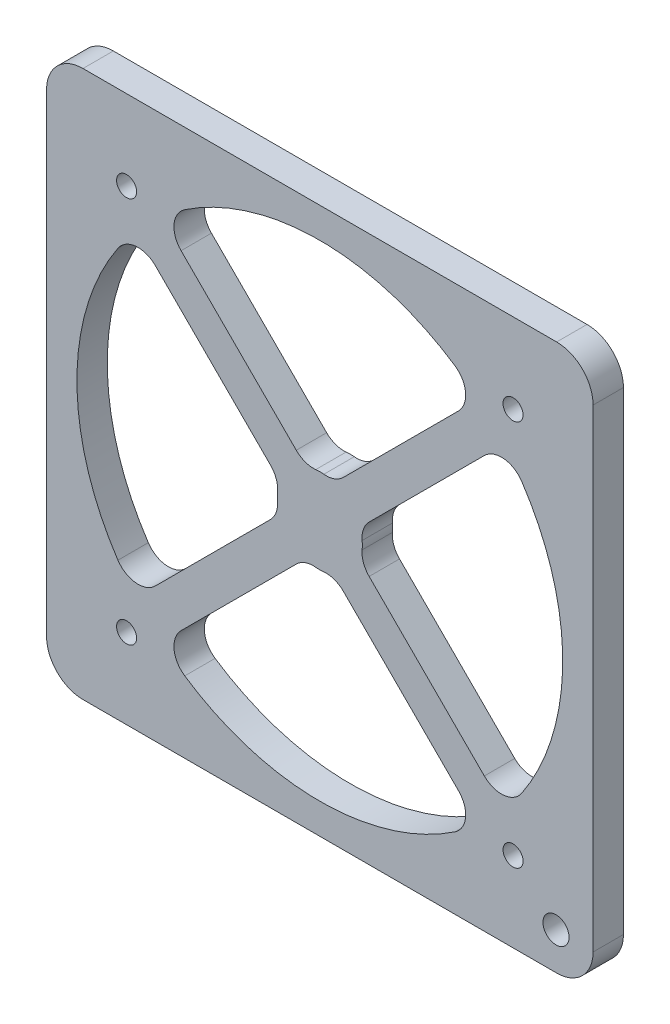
ISO-10303-21;
HEADER;
FILE_DESCRIPTION(('STEP AP214'),'2;1');
FILE_NAME('part.step','',(''),(''),'','','');
FILE_SCHEMA(('AUTOMOTIVE_DESIGN { 1 0 10303 214 1 1 1 1 }'));
ENDSEC;
DATA;
#1=APPLICATION_CONTEXT('core data for automotive mechanical design processes');
#2=APPLICATION_PROTOCOL_DEFINITION('international standard','automotive_design',2000,#1);
#3=PRODUCT_CONTEXT('',#1,'mechanical');
#4=PRODUCT('Part','Part','',(#3));
#5=PRODUCT_RELATED_PRODUCT_CATEGORY('part','',(#4));
#6=PRODUCT_DEFINITION_FORMATION('','',#4);
#7=PRODUCT_DEFINITION_CONTEXT('part definition',#1,'design');
#8=PRODUCT_DEFINITION('design','',#6,#7);
#9=PRODUCT_DEFINITION_SHAPE('','',#8);
#10=(LENGTH_UNIT() NAMED_UNIT(*) SI_UNIT(.MILLI.,.METRE.));
#11=(NAMED_UNIT(*) PLANE_ANGLE_UNIT() SI_UNIT($,.RADIAN.));
#12=(NAMED_UNIT(*) SI_UNIT($,.STERADIAN.) SOLID_ANGLE_UNIT());
#13=UNCERTAINTY_MEASURE_WITH_UNIT(LENGTH_MEASURE(1.E-05),#10,'distance_accuracy_value','');
#14=(GEOMETRIC_REPRESENTATION_CONTEXT(3) GLOBAL_UNCERTAINTY_ASSIGNED_CONTEXT((#13)) GLOBAL_UNIT_ASSIGNED_CONTEXT((#10,
#11,#12)) REPRESENTATION_CONTEXT('',''));
#15=CARTESIAN_POINT('',(0.,0.,0.));
#16=DIRECTION('',(0.,0.,1.));
#17=DIRECTION('',(1.,0.,0.));
#18=AXIS2_PLACEMENT_3D('',#15,#16,#17);
#19=CARTESIAN_POINT('',(0.,-45.,5.));
#20=DIRECTION('',(0.,1.,0.));
#21=DIRECTION('',(0.,0.,1.));
#22=AXIS2_PLACEMENT_3D('',#19,#20,#21);
#23=PLANE('',#22);
#24=DIRECTION('',(1.,0.,0.));
#25=VECTOR('',#24,1.);
#26=CARTESIAN_POINT('',(0.,-45.,5.));
#27=LINE('',#26,#25);
#28=CARTESIAN_POINT('',(-39.,-45.,5.));
#29=VERTEX_POINT('',#28);
#30=CARTESIAN_POINT('',(39.,-45.,5.));
#31=VERTEX_POINT('',#30);
#32=EDGE_CURVE('E698',#29,#31,#27,.T.);
#33=ORIENTED_EDGE('',*,*,#32,.F.);
#34=DIRECTION('',(0.,0.,-1.));
#35=VECTOR('',#34,1.);
#36=CARTESIAN_POINT('',(-39.,-45.,0.));
#37=LINE('',#36,#35);
#38=CARTESIAN_POINT('',(-39.,-45.,0.));
#39=VERTEX_POINT('',#38);
#40=EDGE_CURVE('E591',#29,#39,#37,.T.);
#41=ORIENTED_EDGE('',*,*,#40,.T.);
#42=DIRECTION('',(1.,0.,0.));
#43=VECTOR('',#42,1.);
#44=CARTESIAN_POINT('',(0.,-45.,0.));
#45=LINE('',#44,#43);
#46=CARTESIAN_POINT('',(39.,-45.,0.));
#47=VERTEX_POINT('',#46);
#48=EDGE_CURVE('E367',#39,#47,#45,.T.);
#49=ORIENTED_EDGE('',*,*,#48,.T.);
#50=DIRECTION('',(0.,0.,-1.));
#51=VECTOR('',#50,1.);
#52=CARTESIAN_POINT('',(39.,-45.,5.));
#53=LINE('',#52,#51);
#54=EDGE_CURVE('E588',#47,#31,#53,.F.);
#55=ORIENTED_EDGE('',*,*,#54,.T.);
#56=EDGE_LOOP('',(#33,#41,#49,#55));
#57=FACE_BOUND('',#56,.T.);
#58=ADVANCED_FACE('F46',(#57),#23,.F.);
#59=CARTESIAN_POINT('',(45.,0.,5.));
#60=DIRECTION('',(-1.,0.,0.));
#61=DIRECTION('',(0.,0.,1.));
#62=AXIS2_PLACEMENT_3D('',#59,#60,#61);
#63=PLANE('',#62);
#64=DIRECTION('',(0.,1.,0.));
#65=VECTOR('',#64,1.);
#66=CARTESIAN_POINT('',(45.,0.,5.));
#67=LINE('',#66,#65);
#68=CARTESIAN_POINT('',(45.,-39.,5.));
#69=VERTEX_POINT('',#68);
#70=CARTESIAN_POINT('',(45.,39.,5.));
#71=VERTEX_POINT('',#70);
#72=EDGE_CURVE('E702',#69,#71,#67,.T.);
#73=ORIENTED_EDGE('',*,*,#72,.F.);
#74=DIRECTION('',(0.,0.,-1.));
#75=VECTOR('',#74,1.);
#76=CARTESIAN_POINT('',(45.,-39.,5.));
#77=LINE('',#76,#75);
#78=CARTESIAN_POINT('',(45.,-39.,0.));
#79=VERTEX_POINT('',#78);
#80=EDGE_CURVE('E12',#69,#79,#77,.T.);
#81=ORIENTED_EDGE('',*,*,#80,.T.);
#82=DIRECTION('',(0.,1.,0.));
#83=VECTOR('',#82,1.);
#84=CARTESIAN_POINT('',(45.,0.,0.));
#85=LINE('',#84,#83);
#86=CARTESIAN_POINT('',(45.,39.,0.));
#87=VERTEX_POINT('',#86);
#88=EDGE_CURVE('E371',#79,#87,#85,.T.);
#89=ORIENTED_EDGE('',*,*,#88,.T.);
#90=DIRECTION('',(0.,0.,-1.));
#91=VECTOR('',#90,1.);
#92=CARTESIAN_POINT('',(45.,39.,5.));
#93=LINE('',#92,#91);
#94=EDGE_CURVE('E56',#87,#71,#93,.F.);
#95=ORIENTED_EDGE('',*,*,#94,.T.);
#96=EDGE_LOOP('',(#73,#81,#89,#95));
#97=FACE_BOUND('',#96,.T.);
#98=ADVANCED_FACE('F850',(#97),#63,.F.);
#99=CARTESIAN_POINT('',(0.,45.,5.));
#100=DIRECTION('',(0.,1.,0.));
#101=DIRECTION('',(0.,0.,1.));
#102=AXIS2_PLACEMENT_3D('',#99,#100,#101);
#103=PLANE('',#102);
#104=DIRECTION('',(1.,0.,0.));
#105=VECTOR('',#104,1.);
#106=CARTESIAN_POINT('',(0.,45.,0.));
#107=LINE('',#106,#105);
#108=CARTESIAN_POINT('',(-39.,45.,0.));
#109=VERTEX_POINT('',#108);
#110=CARTESIAN_POINT('',(39.,45.,0.));
#111=VERTEX_POINT('',#110);
#112=EDGE_CURVE('E375',#109,#111,#107,.T.);
#113=ORIENTED_EDGE('',*,*,#112,.F.);
#114=DIRECTION('',(0.,0.,-1.));
#115=VECTOR('',#114,1.);
#116=CARTESIAN_POINT('',(-39.,45.,5.));
#117=LINE('',#116,#115);
#118=CARTESIAN_POINT('',(-39.,45.,5.));
#119=VERTEX_POINT('',#118);
#120=EDGE_CURVE('E71',#109,#119,#117,.F.);
#121=ORIENTED_EDGE('',*,*,#120,.T.);
#122=DIRECTION('',(1.,0.,0.));
#123=VECTOR('',#122,1.);
#124=CARTESIAN_POINT('',(0.,45.,5.));
#125=LINE('',#124,#123);
#126=CARTESIAN_POINT('',(39.,45.,5.));
#127=VERTEX_POINT('',#126);
#128=EDGE_CURVE('E705',#119,#127,#125,.T.);
#129=ORIENTED_EDGE('',*,*,#128,.T.);
#130=DIRECTION('',(0.,0.,-1.));
#131=VECTOR('',#130,1.);
#132=CARTESIAN_POINT('',(39.,45.,0.));
#133=LINE('',#132,#131);
#134=EDGE_CURVE('E625',#127,#111,#133,.T.);
#135=ORIENTED_EDGE('',*,*,#134,.T.);
#136=EDGE_LOOP('',(#113,#121,#129,#135));
#137=FACE_BOUND('',#136,.T.);
#138=ADVANCED_FACE('F856',(#137),#103,.T.);
#139=CARTESIAN_POINT('',(-2.12132034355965,-2.12132034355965,5.));
#140=DIRECTION('',(0.707106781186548,0.707106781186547,0.));
#141=DIRECTION('',(-0.707106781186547,0.707106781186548,0.));
#142=AXIS2_PLACEMENT_3D('',#139,#140,#141);
#143=PLANE('',#142);
#144=DIRECTION('',(0.707106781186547,-0.707106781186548,0.));
#145=VECTOR('',#144,1.);
#146=CARTESIAN_POINT('',(-2.12132034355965,-2.12132034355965,0.));
#147=LINE('',#146,#145);
#148=CARTESIAN_POINT('',(-27.0913023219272,22.8486616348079,0.));
#149=VERTEX_POINT('',#148);
#150=CARTESIAN_POINT('',(-8.12132034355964,3.87867965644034,0.));
#151=VERTEX_POINT('',#150);
#152=EDGE_CURVE('E359',#149,#151,#147,.T.);
#153=ORIENTED_EDGE('',*,*,#152,.T.);
#154=DIRECTION('',(0.,0.,1.));
#155=VECTOR('',#154,1.);
#156=CARTESIAN_POINT('',(-8.12132034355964,3.87867965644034,5.));
#157=LINE('',#156,#155);
#158=CARTESIAN_POINT('',(-8.12132034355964,3.87867965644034,5.));
#159=VERTEX_POINT('',#158);
#160=EDGE_CURVE('E492',#151,#159,#157,.T.);
#161=ORIENTED_EDGE('',*,*,#160,.T.);
#162=DIRECTION('',(0.707106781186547,-0.707106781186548,0.));
#163=VECTOR('',#162,1.);
#164=CARTESIAN_POINT('',(-2.12132034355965,-2.12132034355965,5.));
#165=LINE('',#164,#163);
#166=CARTESIAN_POINT('',(-27.0913023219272,22.8486616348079,5.));
#167=VERTEX_POINT('',#166);
#168=EDGE_CURVE('E690',#167,#159,#165,.T.);
#169=ORIENTED_EDGE('',*,*,#168,.F.);
#170=DIRECTION('',(0.,0.,-1.));
#171=VECTOR('',#170,1.);
#172=CARTESIAN_POINT('',(-27.0913023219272,22.8486616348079,5.));
#173=LINE('',#172,#171);
#174=EDGE_CURVE('E393',#167,#149,#173,.T.);
#175=ORIENTED_EDGE('',*,*,#174,.T.);
#176=EDGE_LOOP('',(#153,#161,#169,#175));
#177=FACE_BOUND('',#176,.T.);
#178=ADVANCED_FACE('F872',(#177),#143,.F.);
#179=CARTESIAN_POINT('',(0.,0.,5.));
#180=DIRECTION('',(0.,0.,-1.));
#181=DIRECTION('',(-1.,0.,0.));
#182=AXIS2_PLACEMENT_3D('',#179,#180,#181);
#183=CYLINDRICAL_SURFACE('',#182,7.);
#184=CARTESIAN_POINT('',(0.,0.,5.));
#185=DIRECTION('',(0.,0.,1.));
#186=DIRECTION('',(1.,0.,0.));
#187=AXIS2_PLACEMENT_3D('',#184,#185,#186);
#188=CIRCLE('',#187,7.);
#189=CARTESIAN_POINT('',(-6.96802111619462,0.668342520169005,5.));
#190=VERTEX_POINT('',#189);
#191=CARTESIAN_POINT('',(-6.96802111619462,-0.668342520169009,5.));
#192=VERTEX_POINT('',#191);
#193=EDGE_CURVE('E669',#190,#192,#188,.T.);
#194=ORIENTED_EDGE('',*,*,#193,.F.);
#195=DIRECTION('',(0.,0.,-1.));
#196=VECTOR('',#195,1.);
#197=CARTESIAN_POINT('',(-6.96802111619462,0.668342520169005,5.));
#198=LINE('',#197,#196);
#199=CARTESIAN_POINT('',(-6.96802111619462,0.668342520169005,0.));
#200=VERTEX_POINT('',#199);
#201=EDGE_CURVE('E488',#190,#200,#198,.T.);
#202=ORIENTED_EDGE('',*,*,#201,.T.);
#203=CARTESIAN_POINT('',(0.,0.,0.));
#204=DIRECTION('',(0.,0.,1.));
#205=DIRECTION('',(1.,0.,0.));
#206=AXIS2_PLACEMENT_3D('',#203,#204,#205);
#207=CIRCLE('',#206,7.);
#208=CARTESIAN_POINT('',(-6.96802111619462,-0.668342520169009,0.));
#209=VERTEX_POINT('',#208);
#210=EDGE_CURVE('E348',#200,#209,#207,.T.);
#211=ORIENTED_EDGE('',*,*,#210,.T.);
#212=DIRECTION('',(0.,0.,-1.));
#213=VECTOR('',#212,1.);
#214=CARTESIAN_POINT('',(-6.96802111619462,-0.668342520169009,5.));
#215=LINE('',#214,#213);
#216=EDGE_CURVE('E485',#209,#192,#215,.F.);
#217=ORIENTED_EDGE('',*,*,#216,.T.);
#218=EDGE_LOOP('',(#194,#202,#211,#217));
#219=FACE_BOUND('',#218,.T.);
#220=ADVANCED_FACE('F844',(#219),#183,.T.);
#221=CARTESIAN_POINT('',(-2.12132034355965,2.12132034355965,5.));
#222=DIRECTION('',(0.707106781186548,-0.707106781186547,0.));
#223=DIRECTION('',(0.707106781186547,0.707106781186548,0.));
#224=AXIS2_PLACEMENT_3D('',#221,#222,#223);
#225=PLANE('',#224);
#226=DIRECTION('',(-0.707106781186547,-0.707106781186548,0.));
#227=VECTOR('',#226,1.);
#228=CARTESIAN_POINT('',(-2.12132034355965,2.12132034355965,5.));
#229=LINE('',#228,#227);
#230=CARTESIAN_POINT('',(-8.12132034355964,-3.87867965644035,5.));
#231=VERTEX_POINT('',#230);
#232=CARTESIAN_POINT('',(-27.0913023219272,-22.8486616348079,5.));
#233=VERTEX_POINT('',#232);
#234=EDGE_CURVE('E694',#231,#233,#229,.T.);
#235=ORIENTED_EDGE('',*,*,#234,.F.);
#236=DIRECTION('',(0.,0.,1.));
#237=VECTOR('',#236,1.);
#238=CARTESIAN_POINT('',(-8.12132034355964,-3.87867965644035,0.));
#239=LINE('',#238,#237);
#240=CARTESIAN_POINT('',(-8.12132034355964,-3.87867965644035,0.));
#241=VERTEX_POINT('',#240);
#242=EDGE_CURVE('E495',#231,#241,#239,.F.);
#243=ORIENTED_EDGE('',*,*,#242,.T.);
#244=DIRECTION('',(-0.707106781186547,-0.707106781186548,0.));
#245=VECTOR('',#244,1.);
#246=CARTESIAN_POINT('',(-2.12132034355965,2.12132034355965,0.));
#247=LINE('',#246,#245);
#248=CARTESIAN_POINT('',(-27.0913023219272,-22.8486616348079,0.));
#249=VERTEX_POINT('',#248);
#250=EDGE_CURVE('E363',#241,#249,#247,.T.);
#251=ORIENTED_EDGE('',*,*,#250,.T.);
#252=DIRECTION('',(0.,0.,-1.));
#253=VECTOR('',#252,1.);
#254=CARTESIAN_POINT('',(-27.0913023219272,-22.8486616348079,5.));
#255=LINE('',#254,#253);
#256=EDGE_CURVE('E404',#249,#233,#255,.F.);
#257=ORIENTED_EDGE('',*,*,#256,.T.);
#258=EDGE_LOOP('',(#235,#243,#251,#257));
#259=FACE_BOUND('',#258,.T.);
#260=ADVANCED_FACE('F864',(#259),#225,.F.);
#261=CARTESIAN_POINT('',(-2.12132034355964,2.12132034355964,5.));
#262=DIRECTION('',(0.707106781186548,-0.707106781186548,0.));
#263=DIRECTION('',(0.707106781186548,0.707106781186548,0.));
#264=AXIS2_PLACEMENT_3D('',#261,#262,#263);
#265=PLANE('',#264);
#266=DIRECTION('',(-0.707106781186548,-0.707106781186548,0.));
#267=VECTOR('',#266,1.);
#268=CARTESIAN_POINT('',(-2.12132034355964,2.12132034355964,0.));
#269=LINE('',#268,#267);
#270=CARTESIAN_POINT('',(22.8486616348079,27.0913023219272,0.));
#271=VERTEX_POINT('',#270);
#272=CARTESIAN_POINT('',(3.87867965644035,8.12132034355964,0.));
#273=VERTEX_POINT('',#272);
#274=EDGE_CURVE('E326',#271,#273,#269,.T.);
#275=ORIENTED_EDGE('',*,*,#274,.T.);
#276=DIRECTION('',(0.,0.,1.));
#277=VECTOR('',#276,1.);
#278=CARTESIAN_POINT('',(3.87867965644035,8.12132034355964,5.));
#279=LINE('',#278,#277);
#280=CARTESIAN_POINT('',(3.87867965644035,8.12132034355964,5.));
#281=VERTEX_POINT('',#280);
#282=EDGE_CURVE('E538',#273,#281,#279,.T.);
#283=ORIENTED_EDGE('',*,*,#282,.T.);
#284=DIRECTION('',(-0.707106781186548,-0.707106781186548,0.));
#285=VECTOR('',#284,1.);
#286=CARTESIAN_POINT('',(-2.12132034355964,2.12132034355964,5.));
#287=LINE('',#286,#285);
#288=CARTESIAN_POINT('',(22.8486616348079,27.0913023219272,5.));
#289=VERTEX_POINT('',#288);
#290=EDGE_CURVE('E329',#289,#281,#287,.T.);
#291=ORIENTED_EDGE('',*,*,#290,.F.);
#292=DIRECTION('',(0.,0.,-1.));
#293=VECTOR('',#292,1.);
#294=CARTESIAN_POINT('',(22.8486616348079,27.0913023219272,5.));
#295=LINE('',#294,#293);
#296=EDGE_CURVE('E312',#289,#271,#295,.T.);
#297=ORIENTED_EDGE('',*,*,#296,.T.);
#298=EDGE_LOOP('',(#275,#283,#291,#297));
#299=FACE_BOUND('',#298,.T.);
#300=ADVANCED_FACE('F325',(#299),#265,.F.);
#301=CARTESIAN_POINT('',(0.668342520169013,6.96802111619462,0.));
#302=VERTEX_POINT('',#301);
#303=CARTESIAN_POINT('',(-0.668342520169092,6.96802111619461,0.));
#304=VERTEX_POINT('',#303);
#305=EDGE_CURVE('E339',#302,#304,#207,.T.);
#306=ORIENTED_EDGE('',*,*,#305,.T.);
#307=DIRECTION('',(0.,0.,-1.));
#308=VECTOR('',#307,1.);
#309=CARTESIAN_POINT('',(-0.668342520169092,6.96802111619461,5.));
#310=LINE('',#309,#308);
#311=CARTESIAN_POINT('',(-0.668342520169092,6.96802111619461,5.));
#312=VERTEX_POINT('',#311);
#313=EDGE_CURVE('E535',#304,#312,#310,.F.);
#314=ORIENTED_EDGE('',*,*,#313,.T.);
#315=CARTESIAN_POINT('',(0.668342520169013,6.96802111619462,5.));
#316=VERTEX_POINT('',#315);
#317=EDGE_CURVE('E663',#316,#312,#188,.T.);
#318=ORIENTED_EDGE('',*,*,#317,.F.);
#319=DIRECTION('',(0.,0.,-1.));
#320=VECTOR('',#319,1.);
#321=CARTESIAN_POINT('',(0.668342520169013,6.96802111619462,5.));
#322=LINE('',#321,#320);
#323=EDGE_CURVE('E531',#316,#302,#322,.T.);
#324=ORIENTED_EDGE('',*,*,#323,.T.);
#325=EDGE_LOOP('',(#306,#314,#318,#324));
#326=FACE_BOUND('',#325,.T.);
#327=ADVANCED_FACE('F746',(#326),#183,.T.);
#328=CARTESIAN_POINT('',(2.12132034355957,2.12132034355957,5.));
#329=DIRECTION('',(-0.707106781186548,-0.707106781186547,0.));
#330=DIRECTION('',(0.707106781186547,-0.707106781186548,0.));
#331=AXIS2_PLACEMENT_3D('',#328,#329,#330);
#332=PLANE('',#331);
#333=DIRECTION('',(-0.707106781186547,0.707106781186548,0.));
#334=VECTOR('',#333,1.);
#335=CARTESIAN_POINT('',(2.12132034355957,2.12132034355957,5.));
#336=LINE('',#335,#334);
#337=CARTESIAN_POINT('',(-3.87867965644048,8.12132034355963,5.));
#338=VERTEX_POINT('',#337);
#339=CARTESIAN_POINT('',(-22.848661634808,27.0913023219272,5.));
#340=VERTEX_POINT('',#339);
#341=EDGE_CURVE('E667',#338,#340,#336,.T.);
#342=ORIENTED_EDGE('',*,*,#341,.F.);
#343=DIRECTION('',(0.,0.,1.));
#344=VECTOR('',#343,1.);
#345=CARTESIAN_POINT('',(-3.87867965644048,8.12132034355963,0.));
#346=LINE('',#345,#344);
#347=CARTESIAN_POINT('',(-3.87867965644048,8.12132034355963,0.));
#348=VERTEX_POINT('',#347);
#349=EDGE_CURVE('E527',#338,#348,#346,.F.);
#350=ORIENTED_EDGE('',*,*,#349,.T.);
#351=DIRECTION('',(-0.707106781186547,0.707106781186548,0.));
#352=VECTOR('',#351,1.);
#353=CARTESIAN_POINT('',(2.12132034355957,2.12132034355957,0.));
#354=LINE('',#353,#352);
#355=CARTESIAN_POINT('',(-22.848661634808,27.0913023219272,0.));
#356=VERTEX_POINT('',#355);
#357=EDGE_CURVE('E345',#348,#356,#354,.T.);
#358=ORIENTED_EDGE('',*,*,#357,.T.);
#359=DIRECTION('',(0.,0.,-1.));
#360=VECTOR('',#359,1.);
#361=CARTESIAN_POINT('',(-22.848661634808,27.0913023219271,5.));
#362=LINE('',#361,#360);
#363=EDGE_CURVE('E389',#356,#340,#362,.F.);
#364=ORIENTED_EDGE('',*,*,#363,.T.);
#365=EDGE_LOOP('',(#342,#350,#358,#364));
#366=FACE_BOUND('',#365,.T.);
#367=ADVANCED_FACE('F741',(#366),#332,.F.);
#368=CARTESIAN_POINT('',(2.12132034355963,2.12132034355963,5.));
#369=DIRECTION('',(-0.707106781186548,-0.707106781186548,0.));
#370=DIRECTION('',(0.707106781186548,-0.707106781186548,0.));
#371=AXIS2_PLACEMENT_3D('',#368,#369,#370);
#372=PLANE('',#371);
#373=DIRECTION('',(-0.707106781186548,0.707106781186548,0.));
#374=VECTOR('',#373,1.);
#375=CARTESIAN_POINT('',(2.12132034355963,2.12132034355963,0.));
#376=LINE('',#375,#374);
#377=CARTESIAN_POINT('',(27.0913023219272,-22.8486616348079,0.));
#378=VERTEX_POINT('',#377);
#379=CARTESIAN_POINT('',(8.12132034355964,-3.87867965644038,0.));
#380=VERTEX_POINT('',#379);
#381=EDGE_CURVE('E713',#378,#380,#376,.T.);
#382=ORIENTED_EDGE('',*,*,#381,.T.);
#383=DIRECTION('',(0.,0.,1.));
#384=VECTOR('',#383,1.);
#385=CARTESIAN_POINT('',(8.12132034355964,-3.87867965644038,5.));
#386=LINE('',#385,#384);
#387=CARTESIAN_POINT('',(8.12132034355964,-3.87867965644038,5.));
#388=VERTEX_POINT('',#387);
#389=EDGE_CURVE('E524',#380,#388,#386,.T.);
#390=ORIENTED_EDGE('',*,*,#389,.T.);
#391=DIRECTION('',(-0.707106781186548,0.707106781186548,0.));
#392=VECTOR('',#391,1.);
#393=CARTESIAN_POINT('',(2.12132034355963,2.12132034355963,5.));
#394=LINE('',#393,#392);
#395=CARTESIAN_POINT('',(27.0913023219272,-22.8486616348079,5.));
#396=VERTEX_POINT('',#395);
#397=EDGE_CURVE('E680',#396,#388,#394,.T.);
#398=ORIENTED_EDGE('',*,*,#397,.F.);
#399=DIRECTION('',(0.,0.,-1.));
#400=VECTOR('',#399,1.);
#401=CARTESIAN_POINT('',(27.0913023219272,-22.8486616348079,5.));
#402=LINE('',#401,#400);
#403=EDGE_CURVE('E423',#396,#378,#402,.T.);
#404=ORIENTED_EDGE('',*,*,#403,.T.);
#405=EDGE_LOOP('',(#382,#390,#398,#404));
#406=FACE_BOUND('',#405,.T.);
#407=ADVANCED_FACE('F831',(#406),#372,.F.);
#408=CARTESIAN_POINT('',(6.96802111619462,-0.668342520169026,0.));
#409=VERTEX_POINT('',#408);
#410=CARTESIAN_POINT('',(6.96802111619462,0.668342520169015,0.));
#411=VERTEX_POINT('',#410);
#412=EDGE_CURVE('E347',#409,#411,#207,.T.);
#413=ORIENTED_EDGE('',*,*,#412,.T.);
#414=DIRECTION('',(0.,0.,-1.));
#415=VECTOR('',#414,1.);
#416=CARTESIAN_POINT('',(6.96802111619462,0.668342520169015,5.));
#417=LINE('',#416,#415);
#418=CARTESIAN_POINT('',(6.96802111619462,0.668342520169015,5.));
#419=VERTEX_POINT('',#418);
#420=EDGE_CURVE('E521',#411,#419,#417,.F.);
#421=ORIENTED_EDGE('',*,*,#420,.T.);
#422=CARTESIAN_POINT('',(6.96802111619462,-0.668342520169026,5.));
#423=VERTEX_POINT('',#422);
#424=EDGE_CURVE('E668',#423,#419,#188,.T.);
#425=ORIENTED_EDGE('',*,*,#424,.F.);
#426=DIRECTION('',(0.,0.,-1.));
#427=VECTOR('',#426,1.);
#428=CARTESIAN_POINT('',(6.96802111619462,-0.668342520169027,5.));
#429=LINE('',#428,#427);
#430=EDGE_CURVE('E517',#423,#409,#429,.T.);
#431=ORIENTED_EDGE('',*,*,#430,.T.);
#432=EDGE_LOOP('',(#413,#421,#425,#431));
#433=FACE_BOUND('',#432,.T.);
#434=ADVANCED_FACE('F834',(#433),#183,.T.);
#435=CARTESIAN_POINT('',(2.12132034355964,-2.12132034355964,5.));
#436=DIRECTION('',(-0.707106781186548,0.707106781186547,0.));
#437=DIRECTION('',(-0.707106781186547,-0.707106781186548,0.));
#438=AXIS2_PLACEMENT_3D('',#435,#436,#437);
#439=PLANE('',#438);
#440=DIRECTION('',(0.707106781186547,0.707106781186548,0.));
#441=VECTOR('',#440,1.);
#442=CARTESIAN_POINT('',(2.12132034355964,-2.12132034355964,5.));
#443=LINE('',#442,#441);
#444=CARTESIAN_POINT('',(8.12132034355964,3.87867965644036,5.));
#445=VERTEX_POINT('',#444);
#446=CARTESIAN_POINT('',(27.0913023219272,22.8486616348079,5.));
#447=VERTEX_POINT('',#446);
#448=EDGE_CURVE('E678',#445,#447,#443,.T.);
#449=ORIENTED_EDGE('',*,*,#448,.F.);
#450=DIRECTION('',(0.,0.,1.));
#451=VECTOR('',#450,1.);
#452=CARTESIAN_POINT('',(8.12132034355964,3.87867965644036,0.));
#453=LINE('',#452,#451);
#454=CARTESIAN_POINT('',(8.12132034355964,3.87867965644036,0.));
#455=VERTEX_POINT('',#454);
#456=EDGE_CURVE('E513',#445,#455,#453,.F.);
#457=ORIENTED_EDGE('',*,*,#456,.T.);
#458=DIRECTION('',(0.707106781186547,0.707106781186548,0.));
#459=VECTOR('',#458,1.);
#460=CARTESIAN_POINT('',(2.12132034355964,-2.12132034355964,0.));
#461=LINE('',#460,#459);
#462=CARTESIAN_POINT('',(27.0913023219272,22.8486616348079,0.));
#463=VERTEX_POINT('',#462);
#464=EDGE_CURVE('E350',#455,#463,#461,.T.);
#465=ORIENTED_EDGE('',*,*,#464,.T.);
#466=DIRECTION('',(0.,0.,-1.));
#467=VECTOR('',#466,1.);
#468=CARTESIAN_POINT('',(27.0913023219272,22.8486616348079,5.));
#469=LINE('',#468,#467);
#470=EDGE_CURVE('E320',#463,#447,#469,.F.);
#471=ORIENTED_EDGE('',*,*,#470,.T.);
#472=EDGE_LOOP('',(#449,#457,#465,#471));
#473=FACE_BOUND('',#472,.T.);
#474=ADVANCED_FACE('F814',(#473),#439,.F.);
#475=CARTESIAN_POINT('',(2.12132034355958,-2.12132034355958,5.));
#476=DIRECTION('',(-0.707106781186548,0.707106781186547,0.));
#477=DIRECTION('',(-0.707106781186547,-0.707106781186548,0.));
#478=AXIS2_PLACEMENT_3D('',#475,#476,#477);
#479=PLANE('',#478);
#480=DIRECTION('',(0.707106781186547,0.707106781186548,0.));
#481=VECTOR('',#480,1.);
#482=CARTESIAN_POINT('',(2.12132034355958,-2.12132034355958,0.));
#483=LINE('',#482,#481);
#484=CARTESIAN_POINT('',(-22.848661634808,-27.0913023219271,0.));
#485=VERTEX_POINT('',#484);
#486=CARTESIAN_POINT('',(-3.87867965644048,-8.12132034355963,0.));
#487=VERTEX_POINT('',#486);
#488=EDGE_CURVE('E635',#485,#487,#483,.T.);
#489=ORIENTED_EDGE('',*,*,#488,.T.);
#490=DIRECTION('',(0.,0.,1.));
#491=VECTOR('',#490,1.);
#492=CARTESIAN_POINT('',(-3.87867965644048,-8.12132034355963,5.));
#493=LINE('',#492,#491);
#494=CARTESIAN_POINT('',(-3.87867965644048,-8.12132034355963,5.));
#495=VERTEX_POINT('',#494);
#496=EDGE_CURVE('E506',#487,#495,#493,.T.);
#497=ORIENTED_EDGE('',*,*,#496,.T.);
#498=DIRECTION('',(0.707106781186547,0.707106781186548,0.));
#499=VECTOR('',#498,1.);
#500=CARTESIAN_POINT('',(2.12132034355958,-2.12132034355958,5.));
#501=LINE('',#500,#499);
#502=CARTESIAN_POINT('',(-22.848661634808,-27.0913023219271,5.));
#503=VERTEX_POINT('',#502);
#504=EDGE_CURVE('E382',#503,#495,#501,.T.);
#505=ORIENTED_EDGE('',*,*,#504,.F.);
#506=DIRECTION('',(0.,0.,-1.));
#507=VECTOR('',#506,1.);
#508=CARTESIAN_POINT('',(-22.848661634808,-27.0913023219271,5.));
#509=LINE('',#508,#507);
#510=EDGE_CURVE('E408',#503,#485,#509,.T.);
#511=ORIENTED_EDGE('',*,*,#510,.T.);
#512=EDGE_LOOP('',(#489,#497,#505,#511));
#513=FACE_BOUND('',#512,.T.);
#514=ADVANCED_FACE('F841',(#513),#479,.F.);
#515=CARTESIAN_POINT('',(-0.668342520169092,-6.96802111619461,5.));
#516=VERTEX_POINT('',#515);
#517=CARTESIAN_POINT('',(0.668342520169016,-6.96802111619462,5.));
#518=VERTEX_POINT('',#517);
#519=EDGE_CURVE('E662',#516,#518,#188,.T.);
#520=ORIENTED_EDGE('',*,*,#519,.F.);
#521=DIRECTION('',(0.,0.,-1.));
#522=VECTOR('',#521,1.);
#523=CARTESIAN_POINT('',(-0.668342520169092,-6.96802111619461,5.));
#524=LINE('',#523,#522);
#525=CARTESIAN_POINT('',(-0.668342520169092,-6.96802111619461,0.));
#526=VERTEX_POINT('',#525);
#527=EDGE_CURVE('E502',#516,#526,#524,.T.);
#528=ORIENTED_EDGE('',*,*,#527,.T.);
#529=CARTESIAN_POINT('',(0.668342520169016,-6.96802111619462,0.));
#530=VERTEX_POINT('',#529);
#531=EDGE_CURVE('E641',#526,#530,#207,.T.);
#532=ORIENTED_EDGE('',*,*,#531,.T.);
#533=DIRECTION('',(0.,0.,-1.));
#534=VECTOR('',#533,1.);
#535=CARTESIAN_POINT('',(0.668342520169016,-6.96802111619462,5.));
#536=LINE('',#535,#534);
#537=EDGE_CURVE('E499',#530,#518,#536,.F.);
#538=ORIENTED_EDGE('',*,*,#537,.T.);
#539=EDGE_LOOP('',(#520,#528,#532,#538));
#540=FACE_BOUND('',#539,.T.);
#541=ADVANCED_FACE('F792',(#540),#183,.T.);
#542=CARTESIAN_POINT('',(-2.12132034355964,-2.12132034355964,5.));
#543=DIRECTION('',(0.707106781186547,0.707106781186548,0.));
#544=DIRECTION('',(-0.707106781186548,0.707106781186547,0.));
#545=AXIS2_PLACEMENT_3D('',#542,#543,#544);
#546=PLANE('',#545);
#547=DIRECTION('',(0.707106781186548,-0.707106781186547,0.));
#548=VECTOR('',#547,1.);
#549=CARTESIAN_POINT('',(-2.12132034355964,-2.12132034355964,5.));
#550=LINE('',#549,#548);
#551=CARTESIAN_POINT('',(3.87867965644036,-8.12132034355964,5.));
#552=VERTEX_POINT('',#551);
#553=CARTESIAN_POINT('',(22.8486616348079,-27.0913023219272,5.));
#554=VERTEX_POINT('',#553);
#555=EDGE_CURVE('E670',#552,#554,#550,.T.);
#556=ORIENTED_EDGE('',*,*,#555,.F.);
#557=DIRECTION('',(0.,0.,1.));
#558=VECTOR('',#557,1.);
#559=CARTESIAN_POINT('',(3.87867965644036,-8.12132034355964,0.));
#560=LINE('',#559,#558);
#561=CARTESIAN_POINT('',(3.87867965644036,-8.12132034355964,0.));
#562=VERTEX_POINT('',#561);
#563=EDGE_CURVE('E509',#552,#562,#560,.F.);
#564=ORIENTED_EDGE('',*,*,#563,.T.);
#565=DIRECTION('',(0.707106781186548,-0.707106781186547,0.));
#566=VECTOR('',#565,1.);
#567=CARTESIAN_POINT('',(-2.12132034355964,-2.12132034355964,0.));
#568=LINE('',#567,#566);
#569=CARTESIAN_POINT('',(22.8486616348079,-27.0913023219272,0.));
#570=VERTEX_POINT('',#569);
#571=EDGE_CURVE('E711',#562,#570,#568,.T.);
#572=ORIENTED_EDGE('',*,*,#571,.T.);
#573=DIRECTION('',(0.,0.,-1.));
#574=VECTOR('',#573,1.);
#575=CARTESIAN_POINT('',(22.8486616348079,-27.0913023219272,5.));
#576=LINE('',#575,#574);
#577=EDGE_CURVE('E419',#570,#554,#576,.F.);
#578=ORIENTED_EDGE('',*,*,#577,.T.);
#579=EDGE_LOOP('',(#556,#564,#572,#578));
#580=FACE_BOUND('',#579,.T.);
#581=ADVANCED_FACE('F783',(#580),#546,.F.);
#582=CARTESIAN_POINT('',(0.,0.,5.));
#583=DIRECTION('',(0.,0.,-1.));
#584=DIRECTION('',(-1.,0.,0.));
#585=AXIS2_PLACEMENT_3D('',#582,#583,#584);
#586=CYLINDRICAL_SURFACE('',#585,40.);
#587=CARTESIAN_POINT('',(0.,0.,0.));
#588=DIRECTION('',(0.,0.,1.));
#589=DIRECTION('',(1.,0.,0.));
#590=AXIS2_PLACEMENT_3D('',#587,#588,#589);
#591=CIRCLE('',#590,40.);
#592=CARTESIAN_POINT('',(-33.2441438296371,22.2447050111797,0.));
#593=VERTEX_POINT('',#592);
#594=CARTESIAN_POINT('',(-33.2441438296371,-22.2447050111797,0.));
#595=VERTEX_POINT('',#594);
#596=EDGE_CURVE('E366',#593,#595,#591,.T.);
#597=ORIENTED_EDGE('',*,*,#596,.F.);
#598=DIRECTION('',(0.,0.,-1.));
#599=VECTOR('',#598,1.);
#600=CARTESIAN_POINT('',(-33.2441438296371,22.2447050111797,5.));
#601=LINE('',#600,#599);
#602=CARTESIAN_POINT('',(-33.2441438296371,22.2447050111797,5.));
#603=VERTEX_POINT('',#602);
#604=EDGE_CURVE('E401',#593,#603,#601,.F.);
#605=ORIENTED_EDGE('',*,*,#604,.T.);
#606=CARTESIAN_POINT('',(0.,0.,5.));
#607=DIRECTION('',(0.,0.,1.));
#608=DIRECTION('',(1.,0.,0.));
#609=AXIS2_PLACEMENT_3D('',#606,#607,#608);
#610=CIRCLE('',#609,40.);
#611=CARTESIAN_POINT('',(-33.2441438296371,-22.2447050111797,5.));
#612=VERTEX_POINT('',#611);
#613=EDGE_CURVE('E697',#603,#612,#610,.T.);
#614=ORIENTED_EDGE('',*,*,#613,.T.);
#615=DIRECTION('',(0.,0.,-1.));
#616=VECTOR('',#615,1.);
#617=CARTESIAN_POINT('',(-33.2441438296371,-22.2447050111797,5.));
#618=LINE('',#617,#616);
#619=EDGE_CURVE('E397',#612,#595,#618,.T.);
#620=ORIENTED_EDGE('',*,*,#619,.T.);
#621=EDGE_LOOP('',(#597,#605,#614,#620));
#622=FACE_BOUND('',#621,.T.);
#623=ADVANCED_FACE('F862',(#622),#586,.F.);
#624=CARTESIAN_POINT('',(22.2447050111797,33.2441438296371,0.));
#625=VERTEX_POINT('',#624);
#626=CARTESIAN_POINT('',(-22.2447050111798,33.244143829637,0.));
#627=VERTEX_POINT('',#626);
#628=EDGE_CURVE('E353',#625,#627,#591,.T.);
#629=ORIENTED_EDGE('',*,*,#628,.F.);
#630=DIRECTION('',(0.,0.,-1.));
#631=VECTOR('',#630,1.);
#632=CARTESIAN_POINT('',(22.2447050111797,33.2441438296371,5.));
#633=LINE('',#632,#631);
#634=CARTESIAN_POINT('',(22.2447050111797,33.2441438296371,5.));
#635=VERTEX_POINT('',#634);
#636=EDGE_CURVE('E313',#625,#635,#633,.F.);
#637=ORIENTED_EDGE('',*,*,#636,.T.);
#638=CARTESIAN_POINT('',(-22.2447050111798,33.244143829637,5.));
#639=VERTEX_POINT('',#638);
#640=EDGE_CURVE('E679',#635,#639,#610,.T.);
#641=ORIENTED_EDGE('',*,*,#640,.T.);
#642=DIRECTION('',(0.,0.,-1.));
#643=VECTOR('',#642,1.);
#644=CARTESIAN_POINT('',(-22.2447050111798,33.244143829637,5.));
#645=LINE('',#644,#643);
#646=EDGE_CURVE('E331',#639,#627,#645,.T.);
#647=ORIENTED_EDGE('',*,*,#646,.T.);
#648=EDGE_LOOP('',(#629,#637,#641,#647));
#649=FACE_BOUND('',#648,.T.);
#650=ADVANCED_FACE('F732',(#649),#586,.F.);
#651=CARTESIAN_POINT('',(33.2441438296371,-22.2447050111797,0.));
#652=VERTEX_POINT('',#651);
#653=CARTESIAN_POINT('',(33.2441438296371,22.2447050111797,0.));
#654=VERTEX_POINT('',#653);
#655=EDGE_CURVE('E340',#652,#654,#591,.T.);
#656=ORIENTED_EDGE('',*,*,#655,.F.);
#657=DIRECTION('',(0.,0.,-1.));
#658=VECTOR('',#657,1.);
#659=CARTESIAN_POINT('',(33.2441438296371,-22.2447050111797,5.));
#660=LINE('',#659,#658);
#661=CARTESIAN_POINT('',(33.2441438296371,-22.2447050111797,5.));
#662=VERTEX_POINT('',#661);
#663=EDGE_CURVE('E431',#652,#662,#660,.F.);
#664=ORIENTED_EDGE('',*,*,#663,.T.);
#665=CARTESIAN_POINT('',(33.2441438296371,22.2447050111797,5.));
#666=VERTEX_POINT('',#665);
#667=EDGE_CURVE('E674',#662,#666,#610,.T.);
#668=ORIENTED_EDGE('',*,*,#667,.T.);
#669=DIRECTION('',(0.,0.,-1.));
#670=VECTOR('',#669,1.);
#671=CARTESIAN_POINT('',(33.2441438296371,22.2447050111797,5.));
#672=LINE('',#671,#670);
#673=EDGE_CURVE('E427',#666,#654,#672,.T.);
#674=ORIENTED_EDGE('',*,*,#673,.T.);
#675=EDGE_LOOP('',(#656,#664,#668,#674));
#676=FACE_BOUND('',#675,.T.);
#677=ADVANCED_FACE('F825',(#676),#586,.F.);
#678=CARTESIAN_POINT('',(-22.2447050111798,-33.244143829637,0.));
#679=VERTEX_POINT('',#678);
#680=CARTESIAN_POINT('',(22.2447050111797,-33.2441438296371,0.));
#681=VERTEX_POINT('',#680);
#682=EDGE_CURVE('E352',#679,#681,#591,.T.);
#683=ORIENTED_EDGE('',*,*,#682,.F.);
#684=DIRECTION('',(0.,0.,-1.));
#685=VECTOR('',#684,1.);
#686=CARTESIAN_POINT('',(-22.2447050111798,-33.244143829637,5.));
#687=LINE('',#686,#685);
#688=CARTESIAN_POINT('',(-22.2447050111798,-33.244143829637,5.));
#689=VERTEX_POINT('',#688);
#690=EDGE_CURVE('E416',#679,#689,#687,.F.);
#691=ORIENTED_EDGE('',*,*,#690,.T.);
#692=CARTESIAN_POINT('',(22.2447050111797,-33.2441438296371,5.));
#693=VERTEX_POINT('',#692);
#694=EDGE_CURVE('E673',#689,#693,#610,.T.);
#695=ORIENTED_EDGE('',*,*,#694,.T.);
#696=DIRECTION('',(0.,0.,-1.));
#697=VECTOR('',#696,1.);
#698=CARTESIAN_POINT('',(22.2447050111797,-33.2441438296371,5.));
#699=LINE('',#698,#697);
#700=EDGE_CURVE('E412',#693,#681,#699,.T.);
#701=ORIENTED_EDGE('',*,*,#700,.T.);
#702=EDGE_LOOP('',(#683,#691,#695,#701));
#703=FACE_BOUND('',#702,.T.);
#704=ADVANCED_FACE('F768',(#703),#586,.F.);
#705=CARTESIAN_POINT('',(-45.,0.,5.));
#706=DIRECTION('',(-1.,0.,0.));
#707=DIRECTION('',(0.,0.,1.));
#708=AXIS2_PLACEMENT_3D('',#705,#706,#707);
#709=PLANE('',#708);
#710=DIRECTION('',(0.,1.,0.));
#711=VECTOR('',#710,1.);
#712=CARTESIAN_POINT('',(-45.,0.,0.));
#713=LINE('',#712,#711);
#714=CARTESIAN_POINT('',(-45.,-39.,0.));
#715=VERTEX_POINT('',#714);
#716=CARTESIAN_POINT('',(-45.,39.,0.));
#717=VERTEX_POINT('',#716);
#718=EDGE_CURVE('E379',#715,#717,#713,.T.);
#719=ORIENTED_EDGE('',*,*,#718,.F.);
#720=DIRECTION('',(0.,0.,-1.));
#721=VECTOR('',#720,1.);
#722=CARTESIAN_POINT('',(-45.,-39.,5.));
#723=LINE('',#722,#721);
#724=CARTESIAN_POINT('',(-45.,-39.,5.));
#725=VERTEX_POINT('',#724);
#726=EDGE_CURVE('E611',#715,#725,#723,.F.);
#727=ORIENTED_EDGE('',*,*,#726,.T.);
#728=DIRECTION('',(0.,1.,0.));
#729=VECTOR('',#728,1.);
#730=CARTESIAN_POINT('',(-45.,0.,5.));
#731=LINE('',#730,#729);
#732=CARTESIAN_POINT('',(-45.,39.,5.));
#733=VERTEX_POINT('',#732);
#734=EDGE_CURVE('E332',#725,#733,#731,.T.);
#735=ORIENTED_EDGE('',*,*,#734,.T.);
#736=DIRECTION('',(0.,0.,-1.));
#737=VECTOR('',#736,1.);
#738=CARTESIAN_POINT('',(-45.,39.,5.));
#739=LINE('',#738,#737);
#740=EDGE_CURVE('E607',#733,#717,#739,.T.);
#741=ORIENTED_EDGE('',*,*,#740,.T.);
#742=EDGE_LOOP('',(#719,#727,#735,#741));
#743=FACE_BOUND('',#742,.T.);
#744=ADVANCED_FACE('F905',(#743),#709,.T.);
#745=CARTESIAN_POINT('',(0.,0.,5.));
#746=DIRECTION('',(0.,0.,1.));
#747=DIRECTION('',(1.,0.,0.));
#748=AXIS2_PLACEMENT_3D('',#745,#746,#747);
#749=PLANE('',#748);
#750=CARTESIAN_POINT('',(38.8908729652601,-38.8908729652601,5.));
#751=DIRECTION('',(0.,0.,-1.));
#752=DIRECTION('',(-1.,0.,0.));
#753=AXIS2_PLACEMENT_3D('',#750,#751,#752);
#754=CIRCLE('',#753,2.15);
#755=CARTESIAN_POINT('',(36.7408729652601,-38.8908729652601,5.));
#756=VERTEX_POINT('',#755);
#757=EDGE_CURVE('E1469',#756,#756,#754,.T.);
#758=ORIENTED_EDGE('',*,*,#757,.T.);
#759=EDGE_LOOP('',(#758));
#760=FACE_BOUND('',#759,.T.);
#761=CARTESIAN_POINT('',(31.8198051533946,31.8198051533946,5.));
#762=DIRECTION('',(0.,0.,-1.));
#763=DIRECTION('',(-1.,0.,0.));
#764=AXIS2_PLACEMENT_3D('',#761,#762,#763);
#765=CIRCLE('',#764,1.65);
#766=CARTESIAN_POINT('',(30.1698051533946,31.8198051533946,5.));
#767=VERTEX_POINT('',#766);
#768=EDGE_CURVE('E1463',#767,#767,#765,.T.);
#769=ORIENTED_EDGE('',*,*,#768,.T.);
#770=EDGE_LOOP('',(#769));
#771=FACE_BOUND('',#770,.T.);
#772=CARTESIAN_POINT('',(-31.8198051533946,31.8198051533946,5.));
#773=DIRECTION('',(0.,0.,-1.));
#774=DIRECTION('',(-1.,0.,0.));
#775=AXIS2_PLACEMENT_3D('',#772,#773,#774);
#776=CIRCLE('',#775,1.65);
#777=CARTESIAN_POINT('',(-33.4698051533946,31.8198051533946,5.));
#778=VERTEX_POINT('',#777);
#779=EDGE_CURVE('E1453',#778,#778,#776,.T.);
#780=ORIENTED_EDGE('',*,*,#779,.T.);
#781=EDGE_LOOP('',(#780));
#782=FACE_BOUND('',#781,.T.);
#783=CARTESIAN_POINT('',(-31.8198051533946,-31.8198051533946,5.));
#784=DIRECTION('',(0.,0.,-1.));
#785=DIRECTION('',(-1.,0.,0.));
#786=AXIS2_PLACEMENT_3D('',#783,#784,#785);
#787=CIRCLE('',#786,1.65);
#788=CARTESIAN_POINT('',(-33.4698051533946,-31.8198051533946,5.));
#789=VERTEX_POINT('',#788);
#790=EDGE_CURVE('E655',#789,#789,#787,.T.);
#791=ORIENTED_EDGE('',*,*,#790,.T.);
#792=EDGE_LOOP('',(#791));
#793=FACE_BOUND('',#792,.T.);
#794=CARTESIAN_POINT('',(31.8198051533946,-31.8198051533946,5.));
#795=DIRECTION('',(0.,0.,-1.));
#796=DIRECTION('',(-1.,0.,0.));
#797=AXIS2_PLACEMENT_3D('',#794,#795,#796);
#798=CIRCLE('',#797,1.65);
#799=CARTESIAN_POINT('',(30.1698051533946,-31.8198051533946,5.));
#800=VERTEX_POINT('',#799);
#801=EDGE_CURVE('E644',#800,#800,#798,.T.);
#802=ORIENTED_EDGE('',*,*,#801,.T.);
#803=EDGE_LOOP('',(#802));
#804=FACE_BOUND('',#803,.T.);
#805=ORIENTED_EDGE('',*,*,#694,.F.);
#806=CARTESIAN_POINT('',(-20.0202345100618,-29.9197294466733,5.));
#807=DIRECTION('',(0.,0.,1.));
#808=DIRECTION('',(1.,0.,0.));
#809=AXIS2_PLACEMENT_3D('',#806,#807,#808);
#810=CIRCLE('',#809,4.);
#811=EDGE_CURVE('E462',#689,#503,#810,.F.);
#812=ORIENTED_EDGE('',*,*,#811,.T.);
#813=ORIENTED_EDGE('',*,*,#504,.T.);
#814=CARTESIAN_POINT('',(-1.05025253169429,-10.9497474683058,5.));
#815=DIRECTION('',(0.,0.,1.));
#816=DIRECTION('',(1.,0.,0.));
#817=AXIS2_PLACEMENT_3D('',#814,#815,#816);
#818=CIRCLE('',#817,4.);
#819=EDGE_CURVE('E556',#495,#516,#818,.F.);
#820=ORIENTED_EDGE('',*,*,#819,.T.);
#821=ORIENTED_EDGE('',*,*,#519,.T.);
#822=CARTESIAN_POINT('',(1.05025253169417,-10.9497474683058,5.));
#823=DIRECTION('',(0.,0.,1.));
#824=DIRECTION('',(1.,0.,0.));
#825=AXIS2_PLACEMENT_3D('',#822,#823,#824);
#826=CIRCLE('',#825,4.);
#827=EDGE_CURVE('E562',#518,#552,#826,.F.);
#828=ORIENTED_EDGE('',*,*,#827,.T.);
#829=ORIENTED_EDGE('',*,*,#555,.T.);
#830=CARTESIAN_POINT('',(20.0202345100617,-29.9197294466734,5.));
#831=DIRECTION('',(0.,0.,1.));
#832=DIRECTION('',(1.,0.,0.));
#833=AXIS2_PLACEMENT_3D('',#830,#831,#832);
#834=CIRCLE('',#833,4.);
#835=EDGE_CURVE('E469',#554,#693,#834,.F.);
#836=ORIENTED_EDGE('',*,*,#835,.T.);
#837=EDGE_LOOP('',(#805,#812,#813,#820,#821,#828,#829,#836));
#838=FACE_BOUND('',#837,.T.);
#839=ORIENTED_EDGE('',*,*,#667,.F.);
#840=CARTESIAN_POINT('',(29.9197294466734,-20.0202345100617,5.));
#841=DIRECTION('',(0.,0.,1.));
#842=DIRECTION('',(1.,0.,0.));
#843=AXIS2_PLACEMENT_3D('',#840,#841,#842);
#844=CIRCLE('',#843,4.);
#845=EDGE_CURVE('E475',#662,#396,#844,.F.);
#846=ORIENTED_EDGE('',*,*,#845,.T.);
#847=ORIENTED_EDGE('',*,*,#397,.T.);
#848=CARTESIAN_POINT('',(10.9497474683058,-1.05025253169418,5.));
#849=DIRECTION('',(0.,0.,1.));
#850=DIRECTION('',(1.,0.,0.));
#851=AXIS2_PLACEMENT_3D('',#848,#849,#850);
#852=CIRCLE('',#851,4.);
#853=EDGE_CURVE('E574',#388,#423,#852,.F.);
#854=ORIENTED_EDGE('',*,*,#853,.T.);
#855=ORIENTED_EDGE('',*,*,#424,.T.);
#856=CARTESIAN_POINT('',(10.9497474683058,1.05025253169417,5.));
#857=DIRECTION('',(0.,0.,1.));
#858=DIRECTION('',(1.,0.,0.));
#859=AXIS2_PLACEMENT_3D('',#856,#857,#858);
#860=CIRCLE('',#859,4.);
#861=EDGE_CURVE('E568',#419,#445,#860,.F.);
#862=ORIENTED_EDGE('',*,*,#861,.T.);
#863=ORIENTED_EDGE('',*,*,#448,.T.);
#864=CARTESIAN_POINT('',(29.9197294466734,20.0202345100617,5.));
#865=DIRECTION('',(0.,0.,1.));
#866=DIRECTION('',(1.,0.,0.));
#867=AXIS2_PLACEMENT_3D('',#864,#865,#866);
#868=CIRCLE('',#867,4.);
#869=EDGE_CURVE('E482',#447,#666,#868,.F.);
#870=ORIENTED_EDGE('',*,*,#869,.T.);
#871=EDGE_LOOP('',(#839,#846,#847,#854,#855,#862,#863,#870));
#872=FACE_BOUND('',#871,.T.);
#873=ORIENTED_EDGE('',*,*,#640,.F.);
#874=CARTESIAN_POINT('',(20.0202345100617,29.9197294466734,5.));
#875=DIRECTION('',(0.,0.,1.));
#876=DIRECTION('',(1.,0.,0.));
#877=AXIS2_PLACEMENT_3D('',#874,#875,#876);
#878=CIRCLE('',#877,4.);
#879=EDGE_CURVE('E319',#635,#289,#878,.F.);
#880=ORIENTED_EDGE('',*,*,#879,.T.);
#881=ORIENTED_EDGE('',*,*,#290,.T.);
#882=CARTESIAN_POINT('',(1.05025253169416,10.9497474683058,5.));
#883=DIRECTION('',(0.,0.,1.));
#884=DIRECTION('',(1.,0.,0.));
#885=AXIS2_PLACEMENT_3D('',#882,#883,#884);
#886=CIRCLE('',#885,4.);
#887=EDGE_CURVE('E585',#281,#316,#886,.F.);
#888=ORIENTED_EDGE('',*,*,#887,.T.);
#889=ORIENTED_EDGE('',*,*,#317,.T.);
#890=CARTESIAN_POINT('',(-1.05025253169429,10.9497474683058,5.));
#891=DIRECTION('',(0.,0.,1.));
#892=DIRECTION('',(1.,0.,0.));
#893=AXIS2_PLACEMENT_3D('',#890,#891,#892);
#894=CIRCLE('',#893,4.);
#895=EDGE_CURVE('E580',#312,#338,#894,.F.);
#896=ORIENTED_EDGE('',*,*,#895,.T.);
#897=ORIENTED_EDGE('',*,*,#341,.T.);
#898=CARTESIAN_POINT('',(-20.0202345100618,29.9197294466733,5.));
#899=DIRECTION('',(0.,0.,1.));
#900=DIRECTION('',(1.,0.,0.));
#901=AXIS2_PLACEMENT_3D('',#898,#899,#900);
#902=CIRCLE('',#901,4.);
#903=EDGE_CURVE('E443',#340,#639,#902,.F.);
#904=ORIENTED_EDGE('',*,*,#903,.T.);
#905=EDGE_LOOP('',(#873,#880,#881,#888,#889,#896,#897,#904));
#906=FACE_BOUND('',#905,.T.);
#907=ORIENTED_EDGE('',*,*,#613,.F.);
#908=CARTESIAN_POINT('',(-29.9197294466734,20.0202345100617,5.));
#909=DIRECTION('',(0.,0.,1.));
#910=DIRECTION('',(1.,0.,0.));
#911=AXIS2_PLACEMENT_3D('',#908,#909,#910);
#912=CIRCLE('',#911,4.);
#913=EDGE_CURVE('E449',#603,#167,#912,.F.);
#914=ORIENTED_EDGE('',*,*,#913,.T.);
#915=ORIENTED_EDGE('',*,*,#168,.T.);
#916=CARTESIAN_POINT('',(-10.9497474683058,1.05025253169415,5.));
#917=DIRECTION('',(0.,0.,1.));
#918=DIRECTION('',(1.,0.,0.));
#919=AXIS2_PLACEMENT_3D('',#916,#917,#918);
#920=CIRCLE('',#919,4.);
#921=EDGE_CURVE('E544',#159,#190,#920,.F.);
#922=ORIENTED_EDGE('',*,*,#921,.T.);
#923=ORIENTED_EDGE('',*,*,#193,.T.);
#924=CARTESIAN_POINT('',(-10.9497474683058,-1.05025253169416,5.));
#925=DIRECTION('',(0.,0.,1.));
#926=DIRECTION('',(1.,0.,0.));
#927=AXIS2_PLACEMENT_3D('',#924,#925,#926);
#928=CIRCLE('',#927,4.);
#929=EDGE_CURVE('E550',#192,#231,#928,.F.);
#930=ORIENTED_EDGE('',*,*,#929,.T.);
#931=ORIENTED_EDGE('',*,*,#234,.T.);
#932=CARTESIAN_POINT('',(-29.9197294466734,-20.0202345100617,5.));
#933=DIRECTION('',(0.,0.,1.));
#934=DIRECTION('',(1.,0.,0.));
#935=AXIS2_PLACEMENT_3D('',#932,#933,#934);
#936=CIRCLE('',#935,4.);
#937=EDGE_CURVE('E456',#233,#612,#936,.F.);
#938=ORIENTED_EDGE('',*,*,#937,.T.);
#939=EDGE_LOOP('',(#907,#914,#915,#922,#923,#930,#931,#938));
#940=FACE_BOUND('',#939,.T.);
#941=ORIENTED_EDGE('',*,*,#734,.F.);
#942=CARTESIAN_POINT('',(-39.,-39.,5.));
#943=DIRECTION('',(0.,0.,1.));
#944=DIRECTION('',(1.,0.,0.));
#945=AXIS2_PLACEMENT_3D('',#942,#943,#944);
#946=CIRCLE('',#945,6.);
#947=EDGE_CURVE('E622',#725,#29,#946,.T.);
#948=ORIENTED_EDGE('',*,*,#947,.T.);
#949=ORIENTED_EDGE('',*,*,#32,.T.);
#950=CARTESIAN_POINT('',(39.,-39.,5.));
#951=DIRECTION('',(0.,0.,1.));
#952=DIRECTION('',(1.,0.,0.));
#953=AXIS2_PLACEMENT_3D('',#950,#951,#952);
#954=CIRCLE('',#953,6.);
#955=EDGE_CURVE('E616',#31,#69,#954,.T.);
#956=ORIENTED_EDGE('',*,*,#955,.T.);
#957=ORIENTED_EDGE('',*,*,#72,.T.);
#958=CARTESIAN_POINT('',(39.,39.,5.));
#959=DIRECTION('',(0.,0.,1.));
#960=DIRECTION('',(1.,0.,0.));
#961=AXIS2_PLACEMENT_3D('',#958,#959,#960);
#962=CIRCLE('',#961,6.);
#963=EDGE_CURVE('E64',#71,#127,#962,.T.);
#964=ORIENTED_EDGE('',*,*,#963,.T.);
#965=ORIENTED_EDGE('',*,*,#128,.F.);
#966=CARTESIAN_POINT('',(-39.,39.,5.));
#967=DIRECTION('',(0.,0.,1.));
#968=DIRECTION('',(1.,0.,0.));
#969=AXIS2_PLACEMENT_3D('',#966,#967,#968);
#970=CIRCLE('',#969,6.);
#971=EDGE_CURVE('E619',#119,#733,#970,.T.);
#972=ORIENTED_EDGE('',*,*,#971,.T.);
#973=EDGE_LOOP('',(#941,#948,#949,#956,#957,#964,#965,#972));
#974=FACE_BOUND('',#973,.T.);
#975=ADVANCED_FACE('F752',(#760,#771,#782,#793,#804,#838,#872,#906,#940,#974),#749,.T.);
#976=CARTESIAN_POINT('',(0.,0.,0.));
#977=DIRECTION('',(0.,0.,1.));
#978=DIRECTION('',(1.,0.,0.));
#979=AXIS2_PLACEMENT_3D('',#976,#977,#978);
#980=PLANE('',#979);
#981=CARTESIAN_POINT('',(38.8908729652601,-38.8908729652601,0.));
#982=DIRECTION('',(0.,0.,-1.));
#983=DIRECTION('',(-1.,0.,0.));
#984=AXIS2_PLACEMENT_3D('',#981,#982,#983);
#985=CIRCLE('',#984,2.15);
#986=CARTESIAN_POINT('',(36.7408729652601,-38.8908729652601,0.));
#987=VERTEX_POINT('',#986);
#988=EDGE_CURVE('E1436',#987,#987,#985,.T.);
#989=ORIENTED_EDGE('',*,*,#988,.F.);
#990=EDGE_LOOP('',(#989));
#991=FACE_BOUND('',#990,.T.);
#992=CARTESIAN_POINT('',(31.8198051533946,31.8198051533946,0.));
#993=DIRECTION('',(0.,0.,-1.));
#994=DIRECTION('',(-1.,0.,0.));
#995=AXIS2_PLACEMENT_3D('',#992,#993,#994);
#996=CIRCLE('',#995,1.65);
#997=CARTESIAN_POINT('',(30.1698051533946,31.8198051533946,0.));
#998=VERTEX_POINT('',#997);
#999=EDGE_CURVE('E1440',#998,#998,#996,.T.);
#1000=ORIENTED_EDGE('',*,*,#999,.F.);
#1001=EDGE_LOOP('',(#1000));
#1002=FACE_BOUND('',#1001,.T.);
#1003=CARTESIAN_POINT('',(-31.8198051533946,31.8198051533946,0.));
#1004=DIRECTION('',(0.,0.,-1.));
#1005=DIRECTION('',(-1.,0.,0.));
#1006=AXIS2_PLACEMENT_3D('',#1003,#1004,#1005);
#1007=CIRCLE('',#1006,1.65);
#1008=CARTESIAN_POINT('',(-33.4698051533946,31.8198051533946,0.));
#1009=VERTEX_POINT('',#1008);
#1010=EDGE_CURVE('E1444',#1009,#1009,#1007,.T.);
#1011=ORIENTED_EDGE('',*,*,#1010,.F.);
#1012=EDGE_LOOP('',(#1011));
#1013=FACE_BOUND('',#1012,.T.);
#1014=CARTESIAN_POINT('',(-31.8198051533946,-31.8198051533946,0.));
#1015=DIRECTION('',(0.,0.,-1.));
#1016=DIRECTION('',(-1.,0.,0.));
#1017=AXIS2_PLACEMENT_3D('',#1014,#1015,#1016);
#1018=CIRCLE('',#1017,1.65);
#1019=CARTESIAN_POINT('',(-33.4698051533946,-31.8198051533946,0.));
#1020=VERTEX_POINT('',#1019);
#1021=EDGE_CURVE('E1448',#1020,#1020,#1018,.T.);
#1022=ORIENTED_EDGE('',*,*,#1021,.F.);
#1023=EDGE_LOOP('',(#1022));
#1024=FACE_BOUND('',#1023,.T.);
#1025=CARTESIAN_POINT('',(31.8198051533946,-31.8198051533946,0.));
#1026=DIRECTION('',(0.,0.,-1.));
#1027=DIRECTION('',(-1.,0.,0.));
#1028=AXIS2_PLACEMENT_3D('',#1025,#1026,#1027);
#1029=CIRCLE('',#1028,1.65);
#1030=CARTESIAN_POINT('',(30.1698051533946,-31.8198051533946,0.));
#1031=VERTEX_POINT('',#1030);
#1032=EDGE_CURVE('E649',#1031,#1031,#1029,.T.);
#1033=ORIENTED_EDGE('',*,*,#1032,.F.);
#1034=EDGE_LOOP('',(#1033));
#1035=FACE_BOUND('',#1034,.T.);
#1036=CARTESIAN_POINT('',(0.,0.,0.));
#1037=DIRECTION('',(0.,0.,1.));
#1038=DIRECTION('',(1.,0.,0.));
#1039=AXIS2_PLACEMENT_3D('',#1036,#1037,#1038);
#1040=CIRCLE('',#1039,5.15);
#1041=CARTESIAN_POINT('',(5.15,0.,0.));
#1042=VERTEX_POINT('',#1041);
#1043=EDGE_CURVE('E50',#1042,#1042,#1040,.T.);
#1044=ORIENTED_EDGE('',*,*,#1043,.T.);
#1045=EDGE_LOOP('',(#1044));
#1046=FACE_BOUND('',#1045,.T.);
#1047=ORIENTED_EDGE('',*,*,#488,.F.);
#1048=CARTESIAN_POINT('',(-20.0202345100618,-29.9197294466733,0.));
#1049=DIRECTION('',(0.,0.,1.));
#1050=DIRECTION('',(1.,0.,0.));
#1051=AXIS2_PLACEMENT_3D('',#1048,#1049,#1050);
#1052=CIRCLE('',#1051,4.);
#1053=EDGE_CURVE('E459',#485,#679,#1052,.T.);
#1054=ORIENTED_EDGE('',*,*,#1053,.T.);
#1055=ORIENTED_EDGE('',*,*,#682,.T.);
#1056=CARTESIAN_POINT('',(20.0202345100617,-29.9197294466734,0.));
#1057=DIRECTION('',(0.,0.,1.));
#1058=DIRECTION('',(1.,0.,0.));
#1059=AXIS2_PLACEMENT_3D('',#1056,#1057,#1058);
#1060=CIRCLE('',#1059,4.);
#1061=EDGE_CURVE('E465',#681,#570,#1060,.T.);
#1062=ORIENTED_EDGE('',*,*,#1061,.T.);
#1063=ORIENTED_EDGE('',*,*,#571,.F.);
#1064=CARTESIAN_POINT('',(1.05025253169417,-10.9497474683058,0.));
#1065=DIRECTION('',(0.,0.,1.));
#1066=DIRECTION('',(1.,0.,0.));
#1067=AXIS2_PLACEMENT_3D('',#1064,#1065,#1066);
#1068=CIRCLE('',#1067,4.);
#1069=EDGE_CURVE('E559',#562,#530,#1068,.T.);
#1070=ORIENTED_EDGE('',*,*,#1069,.T.);
#1071=ORIENTED_EDGE('',*,*,#531,.F.);
#1072=CARTESIAN_POINT('',(-1.05025253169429,-10.9497474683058,0.));
#1073=DIRECTION('',(0.,0.,1.));
#1074=DIRECTION('',(1.,0.,0.));
#1075=AXIS2_PLACEMENT_3D('',#1072,#1073,#1074);
#1076=CIRCLE('',#1075,4.);
#1077=EDGE_CURVE('E553',#526,#487,#1076,.T.);
#1078=ORIENTED_EDGE('',*,*,#1077,.T.);
#1079=EDGE_LOOP('',(#1047,#1054,#1055,#1062,#1063,#1070,#1071,#1078));
#1080=FACE_BOUND('',#1079,.T.);
#1081=ORIENTED_EDGE('',*,*,#381,.F.);
#1082=CARTESIAN_POINT('',(29.9197294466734,-20.0202345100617,0.));
#1083=DIRECTION('',(0.,0.,1.));
#1084=DIRECTION('',(1.,0.,0.));
#1085=AXIS2_PLACEMENT_3D('',#1082,#1083,#1084);
#1086=CIRCLE('',#1085,4.);
#1087=EDGE_CURVE('E472',#378,#652,#1086,.T.);
#1088=ORIENTED_EDGE('',*,*,#1087,.T.);
#1089=ORIENTED_EDGE('',*,*,#655,.T.);
#1090=CARTESIAN_POINT('',(29.9197294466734,20.0202345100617,0.));
#1091=DIRECTION('',(0.,0.,1.));
#1092=DIRECTION('',(1.,0.,0.));
#1093=AXIS2_PLACEMENT_3D('',#1090,#1091,#1092);
#1094=CIRCLE('',#1093,4.);
#1095=EDGE_CURVE('E478',#654,#463,#1094,.T.);
#1096=ORIENTED_EDGE('',*,*,#1095,.T.);
#1097=ORIENTED_EDGE('',*,*,#464,.F.);
#1098=CARTESIAN_POINT('',(10.9497474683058,1.05025253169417,0.));
#1099=DIRECTION('',(0.,0.,1.));
#1100=DIRECTION('',(1.,0.,0.));
#1101=AXIS2_PLACEMENT_3D('',#1098,#1099,#1100);
#1102=CIRCLE('',#1101,4.);
#1103=EDGE_CURVE('E565',#455,#411,#1102,.T.);
#1104=ORIENTED_EDGE('',*,*,#1103,.T.);
#1105=ORIENTED_EDGE('',*,*,#412,.F.);
#1106=CARTESIAN_POINT('',(10.9497474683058,-1.05025253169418,0.));
#1107=DIRECTION('',(0.,0.,1.));
#1108=DIRECTION('',(1.,0.,0.));
#1109=AXIS2_PLACEMENT_3D('',#1106,#1107,#1108);
#1110=CIRCLE('',#1109,4.);
#1111=EDGE_CURVE('E571',#409,#380,#1110,.T.);
#1112=ORIENTED_EDGE('',*,*,#1111,.T.);
#1113=EDGE_LOOP('',(#1081,#1088,#1089,#1096,#1097,#1104,#1105,#1112));
#1114=FACE_BOUND('',#1113,.T.);
#1115=ORIENTED_EDGE('',*,*,#274,.F.);
#1116=CARTESIAN_POINT('',(20.0202345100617,29.9197294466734,0.));
#1117=DIRECTION('',(0.,0.,1.));
#1118=DIRECTION('',(1.,0.,0.));
#1119=AXIS2_PLACEMENT_3D('',#1116,#1117,#1118);
#1120=CIRCLE('',#1119,4.);
#1121=EDGE_CURVE('E308',#271,#625,#1120,.T.);
#1122=ORIENTED_EDGE('',*,*,#1121,.T.);
#1123=ORIENTED_EDGE('',*,*,#628,.T.);
#1124=CARTESIAN_POINT('',(-20.0202345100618,29.9197294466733,0.));
#1125=DIRECTION('',(0.,0.,1.));
#1126=DIRECTION('',(1.,0.,0.));
#1127=AXIS2_PLACEMENT_3D('',#1124,#1125,#1126);
#1128=CIRCLE('',#1127,4.);
#1129=EDGE_CURVE('E439',#627,#356,#1128,.T.);
#1130=ORIENTED_EDGE('',*,*,#1129,.T.);
#1131=ORIENTED_EDGE('',*,*,#357,.F.);
#1132=CARTESIAN_POINT('',(-1.05025253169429,10.9497474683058,0.));
#1133=DIRECTION('',(0.,0.,1.));
#1134=DIRECTION('',(1.,0.,0.));
#1135=AXIS2_PLACEMENT_3D('',#1132,#1133,#1134);
#1136=CIRCLE('',#1135,4.);
#1137=EDGE_CURVE('E577',#348,#304,#1136,.T.);
#1138=ORIENTED_EDGE('',*,*,#1137,.T.);
#1139=ORIENTED_EDGE('',*,*,#305,.F.);
#1140=CARTESIAN_POINT('',(1.05025253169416,10.9497474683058,0.));
#1141=DIRECTION('',(0.,0.,1.));
#1142=DIRECTION('',(1.,0.,0.));
#1143=AXIS2_PLACEMENT_3D('',#1140,#1141,#1142);
#1144=CIRCLE('',#1143,4.);
#1145=EDGE_CURVE('E337',#302,#273,#1144,.T.);
#1146=ORIENTED_EDGE('',*,*,#1145,.T.);
#1147=EDGE_LOOP('',(#1115,#1122,#1123,#1130,#1131,#1138,#1139,#1146));
#1148=FACE_BOUND('',#1147,.T.);
#1149=ORIENTED_EDGE('',*,*,#152,.F.);
#1150=CARTESIAN_POINT('',(-29.9197294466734,20.0202345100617,0.));
#1151=DIRECTION('',(0.,0.,1.));
#1152=DIRECTION('',(1.,0.,0.));
#1153=AXIS2_PLACEMENT_3D('',#1150,#1151,#1152);
#1154=CIRCLE('',#1153,4.);
#1155=EDGE_CURVE('E446',#149,#593,#1154,.T.);
#1156=ORIENTED_EDGE('',*,*,#1155,.T.);
#1157=ORIENTED_EDGE('',*,*,#596,.T.);
#1158=CARTESIAN_POINT('',(-29.9197294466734,-20.0202345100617,0.));
#1159=DIRECTION('',(0.,0.,1.));
#1160=DIRECTION('',(1.,0.,0.));
#1161=AXIS2_PLACEMENT_3D('',#1158,#1159,#1160);
#1162=CIRCLE('',#1161,4.);
#1163=EDGE_CURVE('E452',#595,#249,#1162,.T.);
#1164=ORIENTED_EDGE('',*,*,#1163,.T.);
#1165=ORIENTED_EDGE('',*,*,#250,.F.);
#1166=CARTESIAN_POINT('',(-10.9497474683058,-1.05025253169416,0.));
#1167=DIRECTION('',(0.,0.,1.));
#1168=DIRECTION('',(1.,0.,0.));
#1169=AXIS2_PLACEMENT_3D('',#1166,#1167,#1168);
#1170=CIRCLE('',#1169,4.);
#1171=EDGE_CURVE('E547',#241,#209,#1170,.T.);
#1172=ORIENTED_EDGE('',*,*,#1171,.T.);
#1173=ORIENTED_EDGE('',*,*,#210,.F.);
#1174=CARTESIAN_POINT('',(-10.9497474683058,1.05025253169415,0.));
#1175=DIRECTION('',(0.,0.,1.));
#1176=DIRECTION('',(1.,0.,0.));
#1177=AXIS2_PLACEMENT_3D('',#1174,#1175,#1176);
#1178=CIRCLE('',#1177,4.);
#1179=EDGE_CURVE('E541',#200,#151,#1178,.T.);
#1180=ORIENTED_EDGE('',*,*,#1179,.T.);
#1181=EDGE_LOOP('',(#1149,#1156,#1157,#1164,#1165,#1172,#1173,#1180));
#1182=FACE_BOUND('',#1181,.T.);
#1183=ORIENTED_EDGE('',*,*,#48,.F.);
#1184=CARTESIAN_POINT('',(-39.,-39.,0.));
#1185=DIRECTION('',(0.,0.,1.));
#1186=DIRECTION('',(1.,0.,0.));
#1187=AXIS2_PLACEMENT_3D('',#1184,#1185,#1186);
#1188=CIRCLE('',#1187,6.);
#1189=EDGE_CURVE('E604',#39,#715,#1188,.F.);
#1190=ORIENTED_EDGE('',*,*,#1189,.T.);
#1191=ORIENTED_EDGE('',*,*,#718,.T.);
#1192=CARTESIAN_POINT('',(-39.,39.,0.));
#1193=DIRECTION('',(0.,0.,1.));
#1194=DIRECTION('',(1.,0.,0.));
#1195=AXIS2_PLACEMENT_3D('',#1192,#1193,#1194);
#1196=CIRCLE('',#1195,6.);
#1197=EDGE_CURVE('E601',#717,#109,#1196,.F.);
#1198=ORIENTED_EDGE('',*,*,#1197,.T.);
#1199=ORIENTED_EDGE('',*,*,#112,.T.);
#1200=CARTESIAN_POINT('',(39.,39.,0.));
#1201=DIRECTION('',(0.,0.,1.));
#1202=DIRECTION('',(1.,0.,0.));
#1203=AXIS2_PLACEMENT_3D('',#1200,#1201,#1202);
#1204=CIRCLE('',#1203,6.);
#1205=EDGE_CURVE('E595',#111,#87,#1204,.F.);
#1206=ORIENTED_EDGE('',*,*,#1205,.T.);
#1207=ORIENTED_EDGE('',*,*,#88,.F.);
#1208=CARTESIAN_POINT('',(39.,-39.,0.));
#1209=DIRECTION('',(0.,0.,1.));
#1210=DIRECTION('',(1.,0.,0.));
#1211=AXIS2_PLACEMENT_3D('',#1208,#1209,#1210);
#1212=CIRCLE('',#1211,6.);
#1213=EDGE_CURVE('E598',#79,#47,#1212,.F.);
#1214=ORIENTED_EDGE('',*,*,#1213,.T.);
#1215=EDGE_LOOP('',(#1183,#1190,#1191,#1198,#1199,#1206,#1207,#1214));
#1216=FACE_BOUND('',#1215,.T.);
#1217=ADVANCED_FACE('F334',(#991,#1002,#1013,#1024,#1035,#1046,#1080,#1114,#1148,#1182,#1216),
#980,.F.);
#1218=CARTESIAN_POINT('',(0.,0.,3.));
#1219=DIRECTION('',(0.,0.,-1.));
#1220=DIRECTION('',(-1.,0.,0.));
#1221=AXIS2_PLACEMENT_3D('',#1218,#1219,#1220);
#1222=CYLINDRICAL_SURFACE('',#1221,5.15);
#1223=CARTESIAN_POINT('',(0.,0.,3.));
#1224=DIRECTION('',(0.,0.,1.));
#1225=DIRECTION('',(1.,0.,0.));
#1226=AXIS2_PLACEMENT_3D('',#1223,#1224,#1225);
#1227=CIRCLE('',#1226,5.15);
#1228=CARTESIAN_POINT('',(5.15,0.,3.));
#1229=VERTEX_POINT('',#1228);
#1230=EDGE_CURVE('E632',#1229,#1229,#1227,.T.);
#1231=ORIENTED_EDGE('',*,*,#1230,.T.);
#1232=EDGE_LOOP('',(#1231));
#1233=FACE_BOUND('',#1232,.T.);
#1234=ORIENTED_EDGE('',*,*,#1043,.F.);
#1235=EDGE_LOOP('',(#1234));
#1236=FACE_BOUND('',#1235,.T.);
#1237=ADVANCED_FACE('F48',(#1233,#1236),#1222,.F.);
#1238=CARTESIAN_POINT('',(0.,0.,3.));
#1239=DIRECTION('',(0.,0.,1.));
#1240=DIRECTION('',(1.,0.,0.));
#1241=AXIS2_PLACEMENT_3D('',#1238,#1239,#1240);
#1242=PLANE('',#1241);
#1243=ORIENTED_EDGE('',*,*,#1230,.F.);
#1244=EDGE_LOOP('',(#1243));
#1245=FACE_BOUND('',#1244,.T.);
#1246=ADVANCED_FACE('F1116',(#1245),#1242,.F.);
#1247=CARTESIAN_POINT('',(31.8198051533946,-31.8198051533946,0.));
#1248=DIRECTION('',(0.,0.,-1.));
#1249=DIRECTION('',(-1.,0.,0.));
#1250=AXIS2_PLACEMENT_3D('',#1247,#1248,#1249);
#1251=CYLINDRICAL_SURFACE('',#1250,1.65);
#1252=ORIENTED_EDGE('',*,*,#801,.F.);
#1253=EDGE_LOOP('',(#1252));
#1254=FACE_BOUND('',#1253,.T.);
#1255=ORIENTED_EDGE('',*,*,#1032,.T.);
#1256=EDGE_LOOP('',(#1255));
#1257=FACE_BOUND('',#1256,.T.);
#1258=ADVANCED_FACE('F1108',(#1254,#1257),#1251,.F.);
#1259=CARTESIAN_POINT('',(-31.8198051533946,-31.8198051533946,0.));
#1260=DIRECTION('',(0.,0.,-1.));
#1261=DIRECTION('',(-1.,0.,0.));
#1262=AXIS2_PLACEMENT_3D('',#1259,#1260,#1261);
#1263=CYLINDRICAL_SURFACE('',#1262,1.65);
#1264=ORIENTED_EDGE('',*,*,#790,.F.);
#1265=EDGE_LOOP('',(#1264));
#1266=FACE_BOUND('',#1265,.T.);
#1267=ORIENTED_EDGE('',*,*,#1021,.T.);
#1268=EDGE_LOOP('',(#1267));
#1269=FACE_BOUND('',#1268,.T.);
#1270=ADVANCED_FACE('F1100',(#1266,#1269),#1263,.F.);
#1271=CARTESIAN_POINT('',(-31.8198051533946,31.8198051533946,0.));
#1272=DIRECTION('',(0.,0.,-1.));
#1273=DIRECTION('',(-1.,0.,0.));
#1274=AXIS2_PLACEMENT_3D('',#1271,#1272,#1273);
#1275=CYLINDRICAL_SURFACE('',#1274,1.65);
#1276=ORIENTED_EDGE('',*,*,#779,.F.);
#1277=EDGE_LOOP('',(#1276));
#1278=FACE_BOUND('',#1277,.T.);
#1279=ORIENTED_EDGE('',*,*,#1010,.T.);
#1280=EDGE_LOOP('',(#1279));
#1281=FACE_BOUND('',#1280,.T.);
#1282=ADVANCED_FACE('F1091',(#1278,#1281),#1275,.F.);
#1283=CARTESIAN_POINT('',(31.8198051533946,31.8198051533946,0.));
#1284=DIRECTION('',(0.,0.,-1.));
#1285=DIRECTION('',(-1.,0.,0.));
#1286=AXIS2_PLACEMENT_3D('',#1283,#1284,#1285);
#1287=CYLINDRICAL_SURFACE('',#1286,1.65);
#1288=ORIENTED_EDGE('',*,*,#768,.F.);
#1289=EDGE_LOOP('',(#1288));
#1290=FACE_BOUND('',#1289,.T.);
#1291=ORIENTED_EDGE('',*,*,#999,.T.);
#1292=EDGE_LOOP('',(#1291));
#1293=FACE_BOUND('',#1292,.T.);
#1294=ADVANCED_FACE('F954',(#1290,#1293),#1287,.F.);
#1295=CARTESIAN_POINT('',(20.0202345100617,29.9197294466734,5.));
#1296=DIRECTION('',(0.,0.,-1.));
#1297=DIRECTION('',(-1.,0.,0.));
#1298=AXIS2_PLACEMENT_3D('',#1295,#1296,#1297);
#1299=CYLINDRICAL_SURFACE('',#1298,4.);
#1300=ORIENTED_EDGE('',*,*,#879,.F.);
#1301=ORIENTED_EDGE('',*,*,#636,.F.);
#1302=ORIENTED_EDGE('',*,*,#1121,.F.);
#1303=ORIENTED_EDGE('',*,*,#296,.F.);
#1304=EDGE_LOOP('',(#1300,#1301,#1302,#1303));
#1305=FACE_BOUND('',#1304,.T.);
#1306=ADVANCED_FACE('F311',(#1305),#1299,.F.);
#1307=CARTESIAN_POINT('',(-20.0202345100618,29.9197294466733,5.));
#1308=DIRECTION('',(0.,0.,-1.));
#1309=DIRECTION('',(-1.,0.,0.));
#1310=AXIS2_PLACEMENT_3D('',#1307,#1308,#1309);
#1311=CYLINDRICAL_SURFACE('',#1310,4.);
#1312=ORIENTED_EDGE('',*,*,#903,.F.);
#1313=ORIENTED_EDGE('',*,*,#363,.F.);
#1314=ORIENTED_EDGE('',*,*,#1129,.F.);
#1315=ORIENTED_EDGE('',*,*,#646,.F.);
#1316=EDGE_LOOP('',(#1312,#1313,#1314,#1315));
#1317=FACE_BOUND('',#1316,.T.);
#1318=ADVANCED_FACE('F738',(#1317),#1311,.F.);
#1319=CARTESIAN_POINT('',(-29.9197294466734,20.0202345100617,5.));
#1320=DIRECTION('',(0.,0.,-1.));
#1321=DIRECTION('',(-1.,0.,0.));
#1322=AXIS2_PLACEMENT_3D('',#1319,#1320,#1321);
#1323=CYLINDRICAL_SURFACE('',#1322,4.);
#1324=ORIENTED_EDGE('',*,*,#913,.F.);
#1325=ORIENTED_EDGE('',*,*,#604,.F.);
#1326=ORIENTED_EDGE('',*,*,#1155,.F.);
#1327=ORIENTED_EDGE('',*,*,#174,.F.);
#1328=EDGE_LOOP('',(#1324,#1325,#1326,#1327));
#1329=FACE_BOUND('',#1328,.T.);
#1330=ADVANCED_FACE('F900',(#1329),#1323,.F.);
#1331=CARTESIAN_POINT('',(-29.9197294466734,-20.0202345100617,5.));
#1332=DIRECTION('',(0.,0.,-1.));
#1333=DIRECTION('',(-1.,0.,0.));
#1334=AXIS2_PLACEMENT_3D('',#1331,#1332,#1333);
#1335=CYLINDRICAL_SURFACE('',#1334,4.);
#1336=ORIENTED_EDGE('',*,*,#937,.F.);
#1337=ORIENTED_EDGE('',*,*,#256,.F.);
#1338=ORIENTED_EDGE('',*,*,#1163,.F.);
#1339=ORIENTED_EDGE('',*,*,#619,.F.);
#1340=EDGE_LOOP('',(#1336,#1337,#1338,#1339));
#1341=FACE_BOUND('',#1340,.T.);
#1342=ADVANCED_FACE('F903',(#1341),#1335,.F.);
#1343=CARTESIAN_POINT('',(-20.0202345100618,-29.9197294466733,5.));
#1344=DIRECTION('',(0.,0.,-1.));
#1345=DIRECTION('',(-1.,0.,0.));
#1346=AXIS2_PLACEMENT_3D('',#1343,#1344,#1345);
#1347=CYLINDRICAL_SURFACE('',#1346,4.);
#1348=ORIENTED_EDGE('',*,*,#811,.F.);
#1349=ORIENTED_EDGE('',*,*,#690,.F.);
#1350=ORIENTED_EDGE('',*,*,#1053,.F.);
#1351=ORIENTED_EDGE('',*,*,#510,.F.);
#1352=EDGE_LOOP('',(#1348,#1349,#1350,#1351));
#1353=FACE_BOUND('',#1352,.T.);
#1354=ADVANCED_FACE('F961',(#1353),#1347,.F.);
#1355=CARTESIAN_POINT('',(20.0202345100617,-29.9197294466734,5.));
#1356=DIRECTION('',(0.,0.,-1.));
#1357=DIRECTION('',(-1.,0.,0.));
#1358=AXIS2_PLACEMENT_3D('',#1355,#1356,#1357);
#1359=CYLINDRICAL_SURFACE('',#1358,4.);
#1360=ORIENTED_EDGE('',*,*,#835,.F.);
#1361=ORIENTED_EDGE('',*,*,#577,.F.);
#1362=ORIENTED_EDGE('',*,*,#1061,.F.);
#1363=ORIENTED_EDGE('',*,*,#700,.F.);
#1364=EDGE_LOOP('',(#1360,#1361,#1362,#1363));
#1365=FACE_BOUND('',#1364,.T.);
#1366=ADVANCED_FACE('F774',(#1365),#1359,.F.);
#1367=CARTESIAN_POINT('',(29.9197294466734,-20.0202345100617,5.));
#1368=DIRECTION('',(0.,0.,-1.));
#1369=DIRECTION('',(-1.,0.,0.));
#1370=AXIS2_PLACEMENT_3D('',#1367,#1368,#1369);
#1371=CYLINDRICAL_SURFACE('',#1370,4.);
#1372=ORIENTED_EDGE('',*,*,#845,.F.);
#1373=ORIENTED_EDGE('',*,*,#663,.F.);
#1374=ORIENTED_EDGE('',*,*,#1087,.F.);
#1375=ORIENTED_EDGE('',*,*,#403,.F.);
#1376=EDGE_LOOP('',(#1372,#1373,#1374,#1375));
#1377=FACE_BOUND('',#1376,.T.);
#1378=ADVANCED_FACE('F828',(#1377),#1371,.F.);
#1379=CARTESIAN_POINT('',(29.9197294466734,20.0202345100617,5.));
#1380=DIRECTION('',(0.,0.,-1.));
#1381=DIRECTION('',(-1.,0.,0.));
#1382=AXIS2_PLACEMENT_3D('',#1379,#1380,#1381);
#1383=CYLINDRICAL_SURFACE('',#1382,4.);
#1384=ORIENTED_EDGE('',*,*,#869,.F.);
#1385=ORIENTED_EDGE('',*,*,#470,.F.);
#1386=ORIENTED_EDGE('',*,*,#1095,.F.);
#1387=ORIENTED_EDGE('',*,*,#673,.F.);
#1388=EDGE_LOOP('',(#1384,#1385,#1386,#1387));
#1389=FACE_BOUND('',#1388,.T.);
#1390=ADVANCED_FACE('F822',(#1389),#1383,.F.);
#1391=CARTESIAN_POINT('',(-10.9497474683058,1.05025253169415,5.));
#1392=DIRECTION('',(0.,0.,-1.));
#1393=DIRECTION('',(-1.,0.,0.));
#1394=AXIS2_PLACEMENT_3D('',#1391,#1392,#1393);
#1395=CYLINDRICAL_SURFACE('',#1394,4.);
#1396=ORIENTED_EDGE('',*,*,#921,.F.);
#1397=ORIENTED_EDGE('',*,*,#160,.F.);
#1398=ORIENTED_EDGE('',*,*,#1179,.F.);
#1399=ORIENTED_EDGE('',*,*,#201,.F.);
#1400=EDGE_LOOP('',(#1396,#1397,#1398,#1399));
#1401=FACE_BOUND('',#1400,.T.);
#1402=ADVANCED_FACE('F893',(#1401),#1395,.F.);
#1403=CARTESIAN_POINT('',(-10.9497474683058,-1.05025253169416,5.));
#1404=DIRECTION('',(0.,0.,-1.));
#1405=DIRECTION('',(-1.,0.,0.));
#1406=AXIS2_PLACEMENT_3D('',#1403,#1404,#1405);
#1407=CYLINDRICAL_SURFACE('',#1406,4.);
#1408=ORIENTED_EDGE('',*,*,#929,.F.);
#1409=ORIENTED_EDGE('',*,*,#216,.F.);
#1410=ORIENTED_EDGE('',*,*,#1171,.F.);
#1411=ORIENTED_EDGE('',*,*,#242,.F.);
#1412=EDGE_LOOP('',(#1408,#1409,#1410,#1411));
#1413=FACE_BOUND('',#1412,.T.);
#1414=ADVANCED_FACE('F881',(#1413),#1407,.F.);
#1415=CARTESIAN_POINT('',(-1.05025253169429,-10.9497474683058,5.));
#1416=DIRECTION('',(0.,0.,-1.));
#1417=DIRECTION('',(-1.,0.,0.));
#1418=AXIS2_PLACEMENT_3D('',#1415,#1416,#1417);
#1419=CYLINDRICAL_SURFACE('',#1418,4.);
#1420=ORIENTED_EDGE('',*,*,#819,.F.);
#1421=ORIENTED_EDGE('',*,*,#496,.F.);
#1422=ORIENTED_EDGE('',*,*,#1077,.F.);
#1423=ORIENTED_EDGE('',*,*,#527,.F.);
#1424=EDGE_LOOP('',(#1420,#1421,#1422,#1423));
#1425=FACE_BOUND('',#1424,.T.);
#1426=ADVANCED_FACE('F975',(#1425),#1419,.F.);
#1427=CARTESIAN_POINT('',(1.05025253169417,-10.9497474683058,5.));
#1428=DIRECTION('',(0.,0.,-1.));
#1429=DIRECTION('',(-1.,0.,0.));
#1430=AXIS2_PLACEMENT_3D('',#1427,#1428,#1429);
#1431=CYLINDRICAL_SURFACE('',#1430,4.);
#1432=ORIENTED_EDGE('',*,*,#827,.F.);
#1433=ORIENTED_EDGE('',*,*,#537,.F.);
#1434=ORIENTED_EDGE('',*,*,#1069,.F.);
#1435=ORIENTED_EDGE('',*,*,#563,.F.);
#1436=EDGE_LOOP('',(#1432,#1433,#1434,#1435));
#1437=FACE_BOUND('',#1436,.T.);
#1438=ADVANCED_FACE('F787',(#1437),#1431,.F.);
#1439=CARTESIAN_POINT('',(10.9497474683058,1.05025253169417,5.));
#1440=DIRECTION('',(0.,0.,-1.));
#1441=DIRECTION('',(-1.,0.,0.));
#1442=AXIS2_PLACEMENT_3D('',#1439,#1440,#1441);
#1443=CYLINDRICAL_SURFACE('',#1442,4.);
#1444=ORIENTED_EDGE('',*,*,#861,.F.);
#1445=ORIENTED_EDGE('',*,*,#420,.F.);
#1446=ORIENTED_EDGE('',*,*,#1103,.F.);
#1447=ORIENTED_EDGE('',*,*,#456,.F.);
#1448=EDGE_LOOP('',(#1444,#1445,#1446,#1447));
#1449=FACE_BOUND('',#1448,.T.);
#1450=ADVANCED_FACE('F811',(#1449),#1443,.F.);
#1451=CARTESIAN_POINT('',(10.9497474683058,-1.05025253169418,5.));
#1452=DIRECTION('',(0.,0.,-1.));
#1453=DIRECTION('',(-1.,0.,0.));
#1454=AXIS2_PLACEMENT_3D('',#1451,#1452,#1453);
#1455=CYLINDRICAL_SURFACE('',#1454,4.);
#1456=ORIENTED_EDGE('',*,*,#853,.F.);
#1457=ORIENTED_EDGE('',*,*,#389,.F.);
#1458=ORIENTED_EDGE('',*,*,#1111,.F.);
#1459=ORIENTED_EDGE('',*,*,#430,.F.);
#1460=EDGE_LOOP('',(#1456,#1457,#1458,#1459));
#1461=FACE_BOUND('',#1460,.T.);
#1462=ADVANCED_FACE('F833',(#1461),#1455,.F.);
#1463=CARTESIAN_POINT('',(-1.05025253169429,10.9497474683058,5.));
#1464=DIRECTION('',(0.,0.,-1.));
#1465=DIRECTION('',(-1.,0.,0.));
#1466=AXIS2_PLACEMENT_3D('',#1463,#1464,#1465);
#1467=CYLINDRICAL_SURFACE('',#1466,4.);
#1468=ORIENTED_EDGE('',*,*,#895,.F.);
#1469=ORIENTED_EDGE('',*,*,#313,.F.);
#1470=ORIENTED_EDGE('',*,*,#1137,.F.);
#1471=ORIENTED_EDGE('',*,*,#349,.F.);
#1472=EDGE_LOOP('',(#1468,#1469,#1470,#1471));
#1473=FACE_BOUND('',#1472,.T.);
#1474=ADVANCED_FACE('F750',(#1473),#1467,.F.);
#1475=CARTESIAN_POINT('',(1.05025253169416,10.9497474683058,5.));
#1476=DIRECTION('',(0.,0.,-1.));
#1477=DIRECTION('',(-1.,0.,0.));
#1478=AXIS2_PLACEMENT_3D('',#1475,#1476,#1477);
#1479=CYLINDRICAL_SURFACE('',#1478,4.);
#1480=ORIENTED_EDGE('',*,*,#887,.F.);
#1481=ORIENTED_EDGE('',*,*,#282,.F.);
#1482=ORIENTED_EDGE('',*,*,#1145,.F.);
#1483=ORIENTED_EDGE('',*,*,#323,.F.);
#1484=EDGE_LOOP('',(#1480,#1481,#1482,#1483));
#1485=FACE_BOUND('',#1484,.T.);
#1486=ADVANCED_FACE('F756',(#1485),#1479,.F.);
#1487=CARTESIAN_POINT('',(38.8908729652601,-38.8908729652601,0.));
#1488=DIRECTION('',(0.,0.,-1.));
#1489=DIRECTION('',(-1.,0.,0.));
#1490=AXIS2_PLACEMENT_3D('',#1487,#1488,#1489);
#1491=CYLINDRICAL_SURFACE('',#1490,2.15);
#1492=ORIENTED_EDGE('',*,*,#757,.F.);
#1493=EDGE_LOOP('',(#1492));
#1494=FACE_BOUND('',#1493,.T.);
#1495=ORIENTED_EDGE('',*,*,#988,.T.);
#1496=EDGE_LOOP('',(#1495));
#1497=FACE_BOUND('',#1496,.T.);
#1498=ADVANCED_FACE('F989',(#1494,#1497),#1491,.F.);
#1499=CARTESIAN_POINT('',(-39.,-39.,5.));
#1500=DIRECTION('',(0.,0.,1.));
#1501=DIRECTION('',(1.,0.,0.));
#1502=AXIS2_PLACEMENT_3D('',#1499,#1500,#1501);
#1503=CYLINDRICAL_SURFACE('',#1502,6.);
#1504=ORIENTED_EDGE('',*,*,#947,.F.);
#1505=ORIENTED_EDGE('',*,*,#726,.F.);
#1506=ORIENTED_EDGE('',*,*,#1189,.F.);
#1507=ORIENTED_EDGE('',*,*,#40,.F.);
#1508=EDGE_LOOP('',(#1504,#1505,#1506,#1507));
#1509=FACE_BOUND('',#1508,.T.);
#1510=ADVANCED_FACE('F916',(#1509),#1503,.T.);
#1511=CARTESIAN_POINT('',(-39.,39.,5.));
#1512=DIRECTION('',(0.,0.,-1.));
#1513=DIRECTION('',(-1.,0.,0.));
#1514=AXIS2_PLACEMENT_3D('',#1511,#1512,#1513);
#1515=CYLINDRICAL_SURFACE('',#1514,6.);
#1516=ORIENTED_EDGE('',*,*,#971,.F.);
#1517=ORIENTED_EDGE('',*,*,#120,.F.);
#1518=ORIENTED_EDGE('',*,*,#1197,.F.);
#1519=ORIENTED_EDGE('',*,*,#740,.F.);
#1520=EDGE_LOOP('',(#1516,#1517,#1518,#1519));
#1521=FACE_BOUND('',#1520,.T.);
#1522=ADVANCED_FACE('F931',(#1521),#1515,.T.);
#1523=CARTESIAN_POINT('',(39.,-39.,5.));
#1524=DIRECTION('',(0.,0.,-1.));
#1525=DIRECTION('',(-1.,0.,0.));
#1526=AXIS2_PLACEMENT_3D('',#1523,#1524,#1525);
#1527=CYLINDRICAL_SURFACE('',#1526,6.);
#1528=ORIENTED_EDGE('',*,*,#955,.F.);
#1529=ORIENTED_EDGE('',*,*,#54,.F.);
#1530=ORIENTED_EDGE('',*,*,#1213,.F.);
#1531=ORIENTED_EDGE('',*,*,#80,.F.);
#1532=EDGE_LOOP('',(#1528,#1529,#1530,#1531));
#1533=FACE_BOUND('',#1532,.T.);
#1534=ADVANCED_FACE('F924',(#1533),#1527,.T.);
#1535=CARTESIAN_POINT('',(39.,39.,5.));
#1536=DIRECTION('',(0.,0.,1.));
#1537=DIRECTION('',(1.,0.,0.));
#1538=AXIS2_PLACEMENT_3D('',#1535,#1536,#1537);
#1539=CYLINDRICAL_SURFACE('',#1538,6.);
#1540=ORIENTED_EDGE('',*,*,#963,.F.);
#1541=ORIENTED_EDGE('',*,*,#94,.F.);
#1542=ORIENTED_EDGE('',*,*,#1205,.F.);
#1543=ORIENTED_EDGE('',*,*,#134,.F.);
#1544=EDGE_LOOP('',(#1540,#1541,#1542,#1543));
#1545=FACE_BOUND('',#1544,.T.);
#1546=ADVANCED_FACE('F929',(#1545),#1539,.T.);
#1547=CLOSED_SHELL('',(#58,#98,#138,#178,#220,#260,#300,#327,#367,#407,#434,#474,#514,#541,#581,
#623,#650,#677,#704,#744,#975,#1217,#1237,#1246,#1258,#1270,#1282,#1294,#1306,#1318,#1330,#1342,
#1354,#1366,#1378,#1390,#1402,#1414,#1426,#1438,#1450,#1462,#1474,#1486,#1498,#1510,#1522,#1534,#1546));
#1548=MANIFOLD_SOLID_BREP('B2',#1547);
#1549=ADVANCED_BREP_SHAPE_REPRESENTATION('',(#18,#1548),#14);
#1550=SHAPE_DEFINITION_REPRESENTATION(#9,#1549);
ENDSEC;
END-ISO-10303-21;
